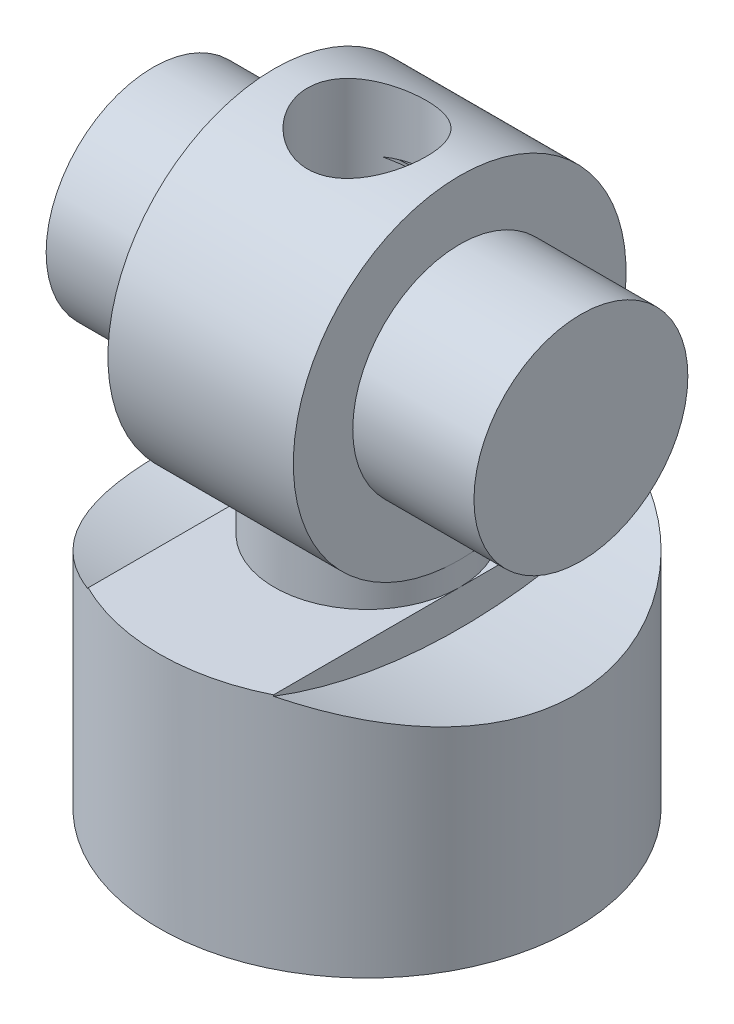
ISO-10303-21;
HEADER;
FILE_DESCRIPTION(('STEP AP214'),'2;1');
FILE_NAME('part.step','',(''),(''),'','','');
FILE_SCHEMA(('AUTOMOTIVE_DESIGN { 1 0 10303 214 1 1 1 1 }'));
ENDSEC;
DATA;
#1=APPLICATION_CONTEXT('core data for automotive mechanical design processes');
#2=APPLICATION_PROTOCOL_DEFINITION('international standard','automotive_design',2000,#1);
#3=PRODUCT_CONTEXT('',#1,'mechanical');
#4=PRODUCT('Part','Part','',(#3));
#5=PRODUCT_RELATED_PRODUCT_CATEGORY('part','',(#4));
#6=PRODUCT_DEFINITION_FORMATION('','',#4);
#7=PRODUCT_DEFINITION_CONTEXT('part definition',#1,'design');
#8=PRODUCT_DEFINITION('design','',#6,#7);
#9=PRODUCT_DEFINITION_SHAPE('','',#8);
#10=(LENGTH_UNIT() NAMED_UNIT(*) SI_UNIT(.MILLI.,.METRE.));
#11=(NAMED_UNIT(*) PLANE_ANGLE_UNIT() SI_UNIT($,.RADIAN.));
#12=(NAMED_UNIT(*) SI_UNIT($,.STERADIAN.) SOLID_ANGLE_UNIT());
#13=UNCERTAINTY_MEASURE_WITH_UNIT(LENGTH_MEASURE(1.E-05),#10,'distance_accuracy_value','');
#14=(GEOMETRIC_REPRESENTATION_CONTEXT(3) GLOBAL_UNCERTAINTY_ASSIGNED_CONTEXT((#13)) GLOBAL_UNIT_ASSIGNED_CONTEXT((#10,
#11,#12)) REPRESENTATION_CONTEXT('',''));
#15=CARTESIAN_POINT('',(0.,0.,0.));
#16=DIRECTION('',(0.,0.,1.));
#17=DIRECTION('',(1.,0.,0.));
#18=AXIS2_PLACEMENT_3D('',#15,#16,#17);
#19=CARTESIAN_POINT('',(3.9,0.,0.));
#20=DIRECTION('',(1.,0.,0.));
#21=DIRECTION('',(0.,0.,-1.));
#22=AXIS2_PLACEMENT_3D('',#19,#20,#21);
#23=CYLINDRICAL_SURFACE('',#22,7.);
#24=CARTESIAN_POINT('',(-3.9,-7.,0.));
#25=CARTESIAN_POINT('',(-3.90000031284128,-7.0000002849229,0.101146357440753));
#26=CARTESIAN_POINT('',(-3.89606076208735,-6.99780299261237,0.202288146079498));
#27=CARTESIAN_POINT('',(-3.8803553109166,-6.98907110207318,0.4038084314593));
#28=CARTESIAN_POINT('',(-3.86858664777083,-6.98253497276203,0.504186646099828));
#29=CARTESIAN_POINT('',(-3.83737541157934,-6.96529106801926,0.70335165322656));
#30=CARTESIAN_POINT('',(-3.81793498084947,-6.95458445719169,0.802138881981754));
#31=CARTESIAN_POINT('',(-3.77162646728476,-6.92927102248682,0.997460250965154));
#32=CARTESIAN_POINT('',(-3.74475533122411,-6.91466259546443,1.09399344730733));
#33=CARTESIAN_POINT('',(-3.65367488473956,-6.8656158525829,1.37844239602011));
#34=CARTESIAN_POINT('',(-3.57884423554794,-6.82586770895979,1.56217036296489));
#35=CARTESIAN_POINT('',(-3.40371798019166,-6.73570207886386,1.91400928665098));
#36=CARTESIAN_POINT('',(-3.30341621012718,-6.68528201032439,2.08211644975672));
#37=CARTESIAN_POINT('',(-3.07231715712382,-6.57405157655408,2.41123481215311));
#38=CARTESIAN_POINT('',(-2.93988015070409,-6.51276165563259,2.57093203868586));
#39=CARTESIAN_POINT('',(-2.65187991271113,-6.38792749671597,2.86710248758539));
#40=CARTESIAN_POINT('',(-2.4962931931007,-6.32438101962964,3.00355181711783));
#41=CARTESIAN_POINT('',(-2.14756313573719,-6.19461051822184,3.26342871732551));
#42=CARTESIAN_POINT('',(-1.9522073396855,-6.12877524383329,3.38410558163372));
#43=CARTESIAN_POINT('',(-1.54017690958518,-6.01028349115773,3.59036592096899));
#44=CARTESIAN_POINT('',(-1.32353352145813,-5.95760808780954,3.67599990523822));
#45=CARTESIAN_POINT('',(-0.922013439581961,-5.88301311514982,3.79393677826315));
#46=CARTESIAN_POINT('',(-0.740093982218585,-5.85694711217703,3.83368428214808));
#47=CARTESIAN_POINT('',(-0.370897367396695,-5.82184998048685,3.88678839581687));
#48=CARTESIAN_POINT('',(-0.183625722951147,-5.81280192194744,3.9001712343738));
#49=CARTESIAN_POINT('',(0.191083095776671,-5.81303377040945,3.89982520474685));
#50=CARTESIAN_POINT('',(0.37852022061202,-5.8223342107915,3.8860659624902));
#51=CARTESIAN_POINT('',(0.747931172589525,-5.85794372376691,3.83216617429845));
#52=CARTESIAN_POINT('',(0.92990134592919,-5.88426391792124,3.79200837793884));
#53=CARTESIAN_POINT('',(1.28390008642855,-5.95046957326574,3.68723511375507));
#54=CARTESIAN_POINT('',(1.45593022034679,-5.99035288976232,3.62262351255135));
#55=CARTESIAN_POINT('',(1.78727171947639,-6.07937613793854,3.47115130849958));
#56=CARTESIAN_POINT('',(1.94657809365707,-6.12851967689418,3.3842820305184));
#57=CARTESIAN_POINT('',(2.2737904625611,-6.23962592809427,3.17538598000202));
#58=CARTESIAN_POINT('',(2.43929114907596,-6.30240002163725,3.05001538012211));
#59=CARTESIAN_POINT('',(2.74839589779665,-6.4283539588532,2.77475098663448));
#60=CARTESIAN_POINT('',(2.89198236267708,-6.49153408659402,2.62483768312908));
#61=CARTESIAN_POINT('',(3.16801707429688,-6.61889865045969,2.28605157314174));
#62=CARTESIAN_POINT('',(3.29781181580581,-6.68252127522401,2.09475977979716));
#63=CARTESIAN_POINT('',(3.46646074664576,-6.76786771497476,1.79084562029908));
#64=CARTESIAN_POINT('',(3.51835131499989,-6.79464354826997,1.68666859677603));
#65=CARTESIAN_POINT('',(3.612893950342,-6.84407556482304,1.47329042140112));
#66=CARTESIAN_POINT('',(3.65555155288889,-6.8667342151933,1.36409232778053));
#67=CARTESIAN_POINT('',(3.72840544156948,-6.90580423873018,1.14932095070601));
#68=CARTESIAN_POINT('',(3.75926673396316,-6.92254271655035,1.04403213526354));
#69=CARTESIAN_POINT('',(3.81209300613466,-6.95137123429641,0.830670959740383));
#70=CARTESIAN_POINT('',(3.83406268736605,-6.96346373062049,0.722600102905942));
#71=CARTESIAN_POINT('',(3.868792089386,-6.9826458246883,0.504603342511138));
#72=CARTESIAN_POINT('',(3.88155641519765,-6.9897379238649,0.394678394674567));
#73=CARTESIAN_POINT('',(3.89769038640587,-6.99871019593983,0.173933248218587));
#74=CARTESIAN_POINT('',(3.90106096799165,-7.00059088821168,0.0631131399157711));
#75=CARTESIAN_POINT('',(3.89851220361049,-6.9991712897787,-0.145684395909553));
#76=CARTESIAN_POINT('',(3.8936119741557,-6.99643934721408,-0.243680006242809));
#77=CARTESIAN_POINT('',(3.87646786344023,-6.98691292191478,-0.438858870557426));
#78=CARTESIAN_POINT('',(3.86422167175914,-6.98011716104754,-0.536041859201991));
#79=CARTESIAN_POINT('',(3.8325365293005,-6.96262599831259,-0.728834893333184));
#80=CARTESIAN_POINT('',(3.81310029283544,-6.95193206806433,-0.824445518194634));
#81=CARTESIAN_POINT('',(3.7672642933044,-6.92689811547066,-1.01350789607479));
#82=CARTESIAN_POINT('',(3.7408618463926,-6.91255668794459,-1.10695880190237));
#83=CARTESIAN_POINT('',(3.65188020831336,-6.86467000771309,-1.38231185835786));
#84=CARTESIAN_POINT('',(3.5793522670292,-6.82616282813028,-1.56025439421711));
#85=CARTESIAN_POINT('',(3.41035528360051,-6.73908732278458,-1.90153537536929));
#86=CARTESIAN_POINT('',(3.31387989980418,-6.69051633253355,-2.06486993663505));
#87=CARTESIAN_POINT('',(3.0884274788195,-6.58161394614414,-2.39055758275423));
#88=CARTESIAN_POINT('',(2.95712331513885,-6.52058610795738,-2.5510686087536));
#89=CARTESIAN_POINT('',(2.67130243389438,-6.39603792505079,-2.8490076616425));
#90=CARTESIAN_POINT('',(2.51676008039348,-6.33251488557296,-2.98640983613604));
#91=CARTESIAN_POINT('',(2.17019140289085,-6.20252665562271,-3.24840604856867));
#92=CARTESIAN_POINT('',(1.97595074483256,-6.13642030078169,-3.37027211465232));
#93=CARTESIAN_POINT('',(1.5660225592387,-6.0169979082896,-3.57914696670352));
#94=CARTESIAN_POINT('',(1.35036576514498,-5.96366390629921,-3.66620482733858));
#95=CARTESIAN_POINT('',(0.949863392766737,-5.88745193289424,-3.78707116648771));
#96=CARTESIAN_POINT('',(0.767997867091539,-5.86053840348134,-3.82820584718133));
#97=CARTESIAN_POINT('',(0.398636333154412,-5.82368322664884,-3.88405483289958));
#98=CARTESIAN_POINT('',(0.211146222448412,-5.81372439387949,-3.89879589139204));
#99=CARTESIAN_POINT('',(-0.16431738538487,-5.81220321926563,-3.90106353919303));
#100=CARTESIAN_POINT('',(-0.352291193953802,-5.82066508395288,-3.88855431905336));
#101=CARTESIAN_POINT('',(-0.722985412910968,-5.85478864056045,-3.83697351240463));
#102=CARTESIAN_POINT('',(-0.905702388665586,-5.88046132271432,-3.79788495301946));
#103=CARTESIAN_POINT('',(-1.26056326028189,-5.94547234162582,-3.69526481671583));
#104=CARTESIAN_POINT('',(-1.43274964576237,-5.98475081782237,-3.63184018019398));
#105=CARTESIAN_POINT('',(-1.76456240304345,-6.07272836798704,-3.48273610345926));
#106=CARTESIAN_POINT('',(-1.92418392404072,-6.12143105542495,-3.39704812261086));
#107=CARTESIAN_POINT('',(-2.25197054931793,-6.23169761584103,-3.1908552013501));
#108=CARTESIAN_POINT('',(-2.41778139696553,-6.29409283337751,-3.06704558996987));
#109=CARTESIAN_POINT('',(-2.72777488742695,-6.41955139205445,-2.79497203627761));
#110=CARTESIAN_POINT('',(-2.87193982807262,-6.48261523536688,-2.64668828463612));
#111=CARTESIAN_POINT('',(-3.14998913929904,-6.61026335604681,-2.31081364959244));
#112=CARTESIAN_POINT('',(-3.28116085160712,-6.67429932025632,-2.12072173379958));
#113=CARTESIAN_POINT('',(-3.45204991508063,-6.76049282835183,-1.81846116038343));
#114=CARTESIAN_POINT('',(-3.50471596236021,-6.787588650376,-1.71481303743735));
#115=CARTESIAN_POINT('',(-3.60086999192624,-6.83773159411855,-1.5024293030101));
#116=CARTESIAN_POINT('',(-3.64436349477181,-6.86078114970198,-1.39369680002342));
#117=CARTESIAN_POINT('',(-3.71848344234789,-6.90045090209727,-1.18090483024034));
#118=CARTESIAN_POINT('',(-3.74986495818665,-6.91743981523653,-1.07717625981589));
#119=CARTESIAN_POINT('',(-3.80397740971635,-6.94692221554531,-0.866908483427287));
#120=CARTESIAN_POINT('',(-3.8267128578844,-6.95941804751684,-0.760370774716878));
#121=CARTESIAN_POINT('',(-3.86321922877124,-6.97955808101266,-0.545364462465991));
#122=CARTESIAN_POINT('',(-3.87699416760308,-6.98720445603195,-0.436896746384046));
#123=CARTESIAN_POINT('',(-3.89538409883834,-6.99742510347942,-0.218950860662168));
#124=CARTESIAN_POINT('',(-3.89999966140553,-6.99999969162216,-0.109472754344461));
#125=CARTESIAN_POINT('',(-3.9,-7.,0.));
#126=B_SPLINE_CURVE_WITH_KNOTS('',3,(#24,#25,#26,#27,#28,#29,#30,#31,#32,#33,#34,#35,#36,#37,
#38,#39,#40,#41,#42,#43,#44,#45,#46,#47,#48,#49,#50,#51,#52,#53,#54,#55,#56,#57,#58,#59,#60,#61,
#62,#63,#64,#65,#66,#67,#68,#69,#70,#71,#72,#73,#74,#75,#76,#77,#78,#79,#80,#81,#82,#83,#84,#85,
#86,#87,#88,#89,#90,#91,#92,#93,#94,#95,#96,#97,#98,#99,#100,#101,#102,#103,#104,#105,#106,#107,
#108,#109,#110,#111,#112,#113,#114,#115,#116,#117,#118,#119,#120,#121,#122,#123,#124,#125),
.UNSPECIFIED.,.T.,.F.,(4,2,2,2,2,2,2,2,2,2,2,2,2,2,2,2,2,2,2,2,2,2,2,2,2,2,2,2,2,2,2,2,2,2,2,2,
2,2,2,2,2,2,2,2,2,2,2,2,2,2,4),(0.,0.303330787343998,0.606768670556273,0.910121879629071,
1.21359992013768,1.81765602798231,2.42185845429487,3.06822728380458,3.71525645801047,
4.42832801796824,5.14036813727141,5.70199096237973,6.26305477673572,6.82474682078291,
7.38680627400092,7.94877689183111,8.51096687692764,9.15905767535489,9.80766618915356,
10.5228095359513,10.8806537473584,11.2382828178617,11.5707819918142,11.903105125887,
12.2352618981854,12.5673855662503,12.8614963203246,13.1556996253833,13.4497919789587,
13.7439978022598,14.3292696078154,14.9146965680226,15.5605601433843,16.2071415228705,
16.9195476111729,17.6309457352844,18.1936677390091,18.7558190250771,19.3187094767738,
19.8819597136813,20.4427626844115,21.0037811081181,21.6495812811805,22.2959067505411,
23.0107914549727,23.3684940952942,23.7259808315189,24.0546214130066,24.383090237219,
24.7114117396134,25.0397128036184),.UNSPECIFIED.);
#127=CARTESIAN_POINT('',(3.9,-7.,0.));
#128=VERTEX_POINT('',#127);
#129=CARTESIAN_POINT('',(-3.9,-7.,0.));
#130=VERTEX_POINT('',#129);
#131=EDGE_CURVE('E183',#128,#130,#126,.T.);
#132=ORIENTED_EDGE('',*,*,#131,.T.);
#133=CARTESIAN_POINT('',(-3.9,0.,0.));
#134=DIRECTION('',(1.,0.,0.));
#135=DIRECTION('',(0.,0.,-1.));
#136=AXIS2_PLACEMENT_3D('',#133,#134,#135);
#137=CIRCLE('',#136,7.);
#138=EDGE_CURVE('E303',#130,#130,#137,.T.);
#139=ORIENTED_EDGE('',*,*,#138,.T.);
#140=EDGE_CURVE('E312',#130,#128,#126,.T.);
#141=ORIENTED_EDGE('',*,*,#140,.T.);
#142=CARTESIAN_POINT('',(3.9,0.,0.));
#143=DIRECTION('',(1.,0.,0.));
#144=DIRECTION('',(0.,0.,-1.));
#145=AXIS2_PLACEMENT_3D('',#142,#143,#144);
#146=CIRCLE('',#145,7.);
#147=EDGE_CURVE('E306',#128,#128,#146,.T.);
#148=ORIENTED_EDGE('',*,*,#147,.F.);
#149=EDGE_LOOP('',(#132,#139,#141,#148));
#150=FACE_BOUND('',#149,.T.);
#151=CARTESIAN_POINT('',(-2.5,7.,0.));
#152=CARTESIAN_POINT('',(-2.49999223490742,6.99999423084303,-0.13564073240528));
#153=CARTESIAN_POINT('',(-2.48890866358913,6.99601508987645,-0.271414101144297));
#154=CARTESIAN_POINT('',(-2.44496507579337,6.98050486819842,-0.539073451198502));
#155=CARTESIAN_POINT('',(-2.41207047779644,6.96896179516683,-0.67095291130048));
#156=CARTESIAN_POINT('',(-2.32580712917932,6.93957817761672,-0.926706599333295));
#157=CARTESIAN_POINT('',(-2.27248899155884,6.92175320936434,-1.05059973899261));
#158=CARTESIAN_POINT('',(-2.14708821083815,6.88160372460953,-1.28763407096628));
#159=CARTESIAN_POINT('',(-2.07500711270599,6.85927957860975,-1.40077614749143));
#160=CARTESIAN_POINT('',(-1.91115888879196,6.81147433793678,-1.61758480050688));
#161=CARTESIAN_POINT('',(-1.81878583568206,6.78590953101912,-1.72077491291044));
#162=CARTESIAN_POINT('',(-1.6182590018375,6.73493649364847,-1.91057783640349));
#163=CARTESIAN_POINT('',(-1.51010025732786,6.70952831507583,-1.99718541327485));
#164=CARTESIAN_POINT('',(-1.276602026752,6.66080066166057,-2.15423743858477));
#165=CARTESIAN_POINT('',(-1.15080488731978,6.63758100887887,-2.22403549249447));
#166=CARTESIAN_POINT('',(-0.888295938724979,6.59714347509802,-2.34127586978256));
#167=CARTESIAN_POINT('',(-0.751588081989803,6.57992343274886,-2.3887262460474));
#168=CARTESIAN_POINT('',(-0.476577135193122,6.55432037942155,-2.45809130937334));
#169=CARTESIAN_POINT('',(-0.338530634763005,6.54562733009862,-2.4809052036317));
#170=CARTESIAN_POINT('',(-0.0603163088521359,6.53715061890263,-2.50316152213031));
#171=CARTESIAN_POINT('',(0.0798507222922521,6.53736369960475,-2.50261249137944));
#172=CARTESIAN_POINT('',(0.350355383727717,6.54640587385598,-2.47885081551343));
#173=CARTESIAN_POINT('',(0.480817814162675,6.55477360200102,-2.45685171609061));
#174=CARTESIAN_POINT('',(0.736061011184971,6.57842075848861,-2.39280867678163));
#175=CARTESIAN_POINT('',(0.860840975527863,6.59370115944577,-2.35076191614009));
#176=CARTESIAN_POINT('',(1.10377675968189,6.62975215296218,-2.24709441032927));
#177=CARTESIAN_POINT('',(1.22177540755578,6.65061550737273,-2.18513901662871));
#178=CARTESIAN_POINT('',(1.44606164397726,6.69544587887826,-2.04364869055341));
#179=CARTESIAN_POINT('',(1.55234602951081,6.71941374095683,-1.96410896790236));
#180=CARTESIAN_POINT('',(1.75694257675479,6.7695208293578,-1.7840468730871));
#181=CARTESIAN_POINT('',(1.85438627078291,6.79570379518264,-1.68254775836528));
#182=CARTESIAN_POINT('',(2.03114616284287,6.84604690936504,-1.46429791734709));
#183=CARTESIAN_POINT('',(2.11045421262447,6.87020614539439,-1.34754037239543));
#184=CARTESIAN_POINT('',(2.24953773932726,6.91418824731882,-1.10000408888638));
#185=CARTESIAN_POINT('',(2.30903444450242,6.93394802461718,-0.969057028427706));
#186=CARTESIAN_POINT('',(2.40477778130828,6.96641261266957,-0.698268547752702));
#187=CARTESIAN_POINT('',(2.44107169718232,6.97913176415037,-0.558445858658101));
#188=CARTESIAN_POINT('',(2.47668095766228,6.99169887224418,-0.347747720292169));
#189=CARTESIAN_POINT('',(2.48541369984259,6.99480177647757,-0.278535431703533));
#190=CARTESIAN_POINT('',(2.49707521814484,6.99895382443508,-0.139560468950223));
#191=CARTESIAN_POINT('',(2.50000399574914,7.00000296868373,-0.0697977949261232));
#192=CARTESIAN_POINT('',(2.49999223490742,6.99999423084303,0.135640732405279));
#193=CARTESIAN_POINT('',(2.48890866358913,6.99601508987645,0.271414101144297));
#194=CARTESIAN_POINT('',(2.44496507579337,6.98050486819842,0.539073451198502));
#195=CARTESIAN_POINT('',(2.41207047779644,6.96896179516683,0.67095291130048));
#196=CARTESIAN_POINT('',(2.32580712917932,6.93957817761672,0.926706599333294));
#197=CARTESIAN_POINT('',(2.27248899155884,6.92175320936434,1.05059973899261));
#198=CARTESIAN_POINT('',(2.14708821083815,6.88160372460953,1.28763407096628));
#199=CARTESIAN_POINT('',(2.07500711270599,6.85927957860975,1.40077614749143));
#200=CARTESIAN_POINT('',(1.91115888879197,6.81147433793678,1.61758480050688));
#201=CARTESIAN_POINT('',(1.81878583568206,6.78590953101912,1.72077491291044));
#202=CARTESIAN_POINT('',(1.6182590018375,6.73493649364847,1.91057783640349));
#203=CARTESIAN_POINT('',(1.51010025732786,6.70952831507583,1.99718541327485));
#204=CARTESIAN_POINT('',(1.276602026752,6.66080066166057,2.15423743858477));
#205=CARTESIAN_POINT('',(1.15080488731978,6.63758100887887,2.22403549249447));
#206=CARTESIAN_POINT('',(0.88829593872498,6.59714347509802,2.34127586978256));
#207=CARTESIAN_POINT('',(0.751588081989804,6.57992343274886,2.3887262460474));
#208=CARTESIAN_POINT('',(0.476577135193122,6.55432037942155,2.45809130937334));
#209=CARTESIAN_POINT('',(0.338530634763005,6.54562733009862,2.4809052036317));
#210=CARTESIAN_POINT('',(0.060316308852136,6.53715061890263,2.50316152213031));
#211=CARTESIAN_POINT('',(-0.0798507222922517,6.53736369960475,2.50261249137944));
#212=CARTESIAN_POINT('',(-0.350355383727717,6.54640587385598,2.47885081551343));
#213=CARTESIAN_POINT('',(-0.480817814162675,6.55477360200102,2.45685171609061));
#214=CARTESIAN_POINT('',(-0.736061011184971,6.57842075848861,2.39280867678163));
#215=CARTESIAN_POINT('',(-0.860840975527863,6.59370115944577,2.35076191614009));
#216=CARTESIAN_POINT('',(-1.10377675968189,6.62975215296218,2.24709441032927));
#217=CARTESIAN_POINT('',(-1.22177540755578,6.65061550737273,2.18513901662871));
#218=CARTESIAN_POINT('',(-1.44606164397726,6.69544587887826,2.04364869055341));
#219=CARTESIAN_POINT('',(-1.55234602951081,6.71941374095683,1.96410896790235));
#220=CARTESIAN_POINT('',(-1.75694257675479,6.7695208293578,1.7840468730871));
#221=CARTESIAN_POINT('',(-1.85438627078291,6.79570379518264,1.68254775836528));
#222=CARTESIAN_POINT('',(-2.03114616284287,6.84604690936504,1.46429791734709));
#223=CARTESIAN_POINT('',(-2.11045421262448,6.87020614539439,1.34754037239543));
#224=CARTESIAN_POINT('',(-2.24953773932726,6.91418824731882,1.10000408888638));
#225=CARTESIAN_POINT('',(-2.30903444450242,6.93394802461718,0.969057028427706));
#226=CARTESIAN_POINT('',(-2.40477778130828,6.96641261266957,0.698268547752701));
#227=CARTESIAN_POINT('',(-2.44107169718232,6.97913176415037,0.5584458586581));
#228=CARTESIAN_POINT('',(-2.47668095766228,6.99169887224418,0.347747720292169));
#229=CARTESIAN_POINT('',(-2.48541369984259,6.99480177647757,0.278535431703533));
#230=CARTESIAN_POINT('',(-2.49707521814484,6.99895382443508,0.139560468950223));
#231=CARTESIAN_POINT('',(-2.50000399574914,7.00000296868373,0.0697977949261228));
#232=CARTESIAN_POINT('',(-2.5,7.,0.));
#233=B_SPLINE_CURVE_WITH_KNOTS('',3,(#151,#152,#153,#154,#155,#156,#157,#158,#159,#160,#161,
#162,#163,#164,#165,#166,#167,#168,#169,#170,#171,#172,#173,#174,#175,#176,#177,#178,#179,#180,
#181,#182,#183,#184,#185,#186,#187,#188,#189,#190,#191,#192,#193,#194,#195,#196,#197,#198,#199,
#200,#201,#202,#203,#204,#205,#206,#207,#208,#209,#210,#211,#212,#213,#214,#215,#216,#217,#218,
#219,#220,#221,#222,#223,#224,#225,#226,#227,#228,#229,#230,#231,#232),.UNSPECIFIED.,.T.,.F.,(4,
2,2,2,2,2,2,2,2,2,2,2,2,2,2,2,2,2,2,2,2,2,2,2,2,2,2,2,2,2,2,2,2,2,2,2,2,2,2,2,4),(0.,
0.406652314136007,0.8139509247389,1.22024664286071,1.62650891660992,2.0471353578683,
2.46789435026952,2.90289671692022,3.3377422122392,3.75611572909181,4.17433622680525,
4.57019166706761,4.96610282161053,5.36905142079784,5.77210992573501,6.1994977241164,
6.62707716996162,7.06044132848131,7.4929195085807,7.70217407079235,7.91142857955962,
8.31808089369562,8.72537950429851,9.13167522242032,9.53793749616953,9.95856393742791,
10.3793229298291,10.8143252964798,11.2491707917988,11.6675443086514,12.0857648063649,
12.4816202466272,12.8775314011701,13.2804800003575,13.6835385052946,14.110926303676,
14.5385057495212,14.9718699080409,15.4043480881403,15.613602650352,15.8228571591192),.UNSPECIFIED.);
#234=CARTESIAN_POINT('',(-2.5,7.,0.));
#235=VERTEX_POINT('',#234);
#236=EDGE_CURVE('E108',#235,#235,#233,.T.);
#237=ORIENTED_EDGE('',*,*,#236,.T.);
#238=EDGE_LOOP('',(#237));
#239=FACE_BOUND('',#238,.T.);
#240=ADVANCED_FACE('F14',(#150,#239),#23,.T.);
#241=CARTESIAN_POINT('',(9.,0.,0.));
#242=DIRECTION('',(-1.,0.,0.));
#243=DIRECTION('',(0.,0.,1.));
#244=AXIS2_PLACEMENT_3D('',#241,#242,#243);
#245=CYLINDRICAL_SURFACE('',#244,4.5);
#246=CARTESIAN_POINT('',(0.,-3.74165738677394,2.5));
#247=CARTESIAN_POINT('',(0.127867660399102,-3.7416726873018,2.4999886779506));
#248=CARTESIAN_POINT('',(0.255847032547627,-3.74831704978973,2.49012046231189));
#249=CARTESIAN_POINT('',(0.507679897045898,-3.77384839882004,2.45123834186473));
#250=CARTESIAN_POINT('',(0.631526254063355,-3.79275551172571,2.42219296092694));
#251=CARTESIAN_POINT('',(0.870945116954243,-3.83989933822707,2.34672518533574));
#252=CARTESIAN_POINT('',(0.986564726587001,-3.86807667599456,2.30041313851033));
#253=CARTESIAN_POINT('',(1.20834600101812,-3.93048941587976,2.19206578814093));
#254=CARTESIAN_POINT('',(1.31450555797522,-3.96472616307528,2.13002699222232));
#255=CARTESIAN_POINT('',(1.52641671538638,-4.03969403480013,1.98449846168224));
#256=CARTESIAN_POINT('',(1.63099357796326,-4.08073069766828,1.89945493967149));
#257=CARTESIAN_POINT('',(1.82534633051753,-4.16222299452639,1.71353751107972));
#258=CARTESIAN_POINT('',(1.91511315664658,-4.20267825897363,1.61265398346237));
#259=CARTESIAN_POINT('',(2.08508983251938,-4.28269640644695,1.3870985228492));
#260=CARTESIAN_POINT('',(2.1637603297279,-4.32186646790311,1.26111369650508));
#261=CARTESIAN_POINT('',(2.29824166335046,-4.39073714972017,0.995108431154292));
#262=CARTESIAN_POINT('',(2.35407027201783,-4.4204451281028,0.85509901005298));
#263=CARTESIAN_POINT('',(2.43630568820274,-4.46480622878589,0.577542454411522));
#264=CARTESIAN_POINT('',(2.46480060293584,-4.48051966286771,0.440787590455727));
#265=CARTESIAN_POINT('',(2.49853448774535,-4.49916269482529,0.163616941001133));
#266=CARTESIAN_POINT('',(2.50379152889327,-4.50210222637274,0.0232040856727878));
#267=CARTESIAN_POINT('',(2.4914765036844,-4.4952695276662,-0.241178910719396));
#268=CARTESIAN_POINT('',(2.47628215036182,-4.48682112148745,-0.365303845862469));
#269=CARTESIAN_POINT('',(2.42789099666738,-4.46029652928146,-0.608906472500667));
#270=CARTESIAN_POINT('',(2.39469280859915,-4.44221960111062,-0.72838380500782));
#271=CARTESIAN_POINT('',(2.31126649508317,-4.39780601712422,-0.960979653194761));
#272=CARTESIAN_POINT('',(2.26086630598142,-4.37138611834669,-1.07401990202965));
#273=CARTESIAN_POINT('',(2.14483738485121,-4.31251997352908,-1.29025059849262));
#274=CARTESIAN_POINT('',(2.07920386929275,-4.28007183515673,-1.39343793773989));
#275=CARTESIAN_POINT('',(1.92640653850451,-4.20785286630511,-1.59909620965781));
#276=CARTESIAN_POINT('',(1.83767397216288,-4.16766932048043,-1.70025747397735));
#277=CARTESIAN_POINT('',(1.64533173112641,-4.08650106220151,-1.88703556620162));
#278=CARTESIAN_POINT('',(1.54170632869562,-4.04551554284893,-1.97263574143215));
#279=CARTESIAN_POINT('',(1.31107929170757,-3.96312397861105,-2.13367090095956));
#280=CARTESIAN_POINT('',(1.1828097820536,-3.92201714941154,-2.2074790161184));
#281=CARTESIAN_POINT('',(0.980669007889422,-3.86749177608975,-2.30082855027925));
#282=CARTESIAN_POINT('',(0.911652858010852,-3.8505034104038,-2.32905476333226));
#283=CARTESIAN_POINT('',(0.770776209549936,-3.81960529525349,-2.3793879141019));
#284=CARTESIAN_POINT('',(0.698917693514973,-3.80569344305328,-2.4014990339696));
#285=CARTESIAN_POINT('',(0.558744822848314,-3.7825660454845,-2.43774893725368));
#286=CARTESIAN_POINT('',(0.49060568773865,-3.77306418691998,-2.45238335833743));
#287=CARTESIAN_POINT('',(0.352979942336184,-3.75764870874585,-2.47593920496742));
#288=CARTESIAN_POINT('',(0.283494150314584,-3.75173297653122,-2.48486399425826));
#289=CARTESIAN_POINT('',(0.143844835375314,-3.7437735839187,-2.49684067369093));
#290=CARTESIAN_POINT('',(0.0736818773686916,-3.74172693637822,-2.49989709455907));
#291=CARTESIAN_POINT('',(-0.0666321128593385,-3.74159115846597,-2.5000979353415));
#292=CARTESIAN_POINT('',(-0.136783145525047,-3.74350157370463,-2.49724303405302));
#293=CARTESIAN_POINT('',(-0.32521266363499,-3.75390669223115,-2.48160454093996));
#294=CARTESIAN_POINT('',(-0.442885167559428,-3.7660681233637,-2.46327912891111));
#295=CARTESIAN_POINT('',(-0.673061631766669,-3.79999671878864,-2.41059641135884));
#296=CARTESIAN_POINT('',(-0.785563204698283,-3.8217682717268,-2.37623178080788));
#297=CARTESIAN_POINT('',(-1.00774180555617,-3.8734200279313,-2.29111009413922));
#298=CARTESIAN_POINT('',(-1.11711092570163,-3.90359765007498,-2.23973536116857));
#299=CARTESIAN_POINT('',(-1.32632576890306,-3.96852930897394,-2.12255957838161));
#300=CARTESIAN_POINT('',(-1.42616680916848,-4.00328557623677,-2.05675148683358));
#301=CARTESIAN_POINT('',(-1.63049062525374,-4.08021308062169,-1.90016864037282));
#302=CARTESIAN_POINT('',(-1.73309682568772,-4.12267224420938,-1.80707526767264));
#303=CARTESIAN_POINT('',(-1.92199935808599,-4.20557655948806,-1.60470900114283));
#304=CARTESIAN_POINT('',(-2.00828561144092,-4.24602045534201,-1.49542618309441));
#305=CARTESIAN_POINT('',(-2.16643294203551,-4.32300875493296,-1.25626042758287));
#306=CARTESIAN_POINT('',(-2.23726807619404,-4.3592262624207,-1.12558547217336));
#307=CARTESIAN_POINT('',(-2.35519631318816,-4.42090637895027,-0.851602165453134));
#308=CARTESIAN_POINT('',(-2.40231447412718,-4.44638033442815,-0.708307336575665));
#309=CARTESIAN_POINT('',(-2.46664777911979,-4.48148519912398,-0.428990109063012));
#310=CARTESIAN_POINT('',(-2.48643742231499,-4.49247473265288,-0.29373267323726));
#311=CARTESIAN_POINT('',(-2.50362240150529,-4.5020067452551,-0.0213910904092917));
#312=CARTESIAN_POINT('',(-2.50103007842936,-4.50055608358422,0.115692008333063));
#313=CARTESIAN_POINT('',(-2.47491437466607,-4.4861017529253,0.374337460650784));
#314=CARTESIAN_POINT('',(-2.45334235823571,-4.47417531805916,0.49616574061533));
#315=CARTESIAN_POINT('',(-2.39292228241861,-4.44133257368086,0.734167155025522));
#316=CARTESIAN_POINT('',(-2.3540722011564,-4.42041521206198,0.8503396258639));
#317=CARTESIAN_POINT('',(-2.25905612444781,-4.3705432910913,1.07814775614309));
#318=CARTESIAN_POINT('',(-2.202363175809,-4.34134725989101,1.18950897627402));
#319=CARTESIAN_POINT('',(-2.07393542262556,-4.27762772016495,1.40148896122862));
#320=CARTESIAN_POINT('',(-2.00219469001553,-4.24310211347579,1.50210346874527));
#321=CARTESIAN_POINT('',(-1.83613517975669,-4.16717195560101,1.70217916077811));
#322=CARTESIAN_POINT('',(-1.74016022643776,-4.12543450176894,1.8001424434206));
#323=CARTESIAN_POINT('',(-1.53330418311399,-4.04252541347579,1.97933250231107));
#324=CARTESIAN_POINT('',(-1.42240466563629,-4.0013545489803,2.06053826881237));
#325=CARTESIAN_POINT('',(-1.17899936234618,-3.92122408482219,2.20944802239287));
#326=CARTESIAN_POINT('',(-1.04552040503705,-3.88262653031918,2.27579178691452));
#327=CARTESIAN_POINT('',(-0.836526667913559,-3.83343009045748,2.35707752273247));
#328=CARTESIAN_POINT('',(-0.765460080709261,-3.81848976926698,2.38112244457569));
#329=CARTESIAN_POINT('',(-0.620861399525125,-3.79215325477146,2.4228459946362));
#330=CARTESIAN_POINT('',(-0.547330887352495,-3.78075483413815,2.44052862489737));
#331=CARTESIAN_POINT('',(-0.395409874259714,-3.7617084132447,2.4697920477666));
#332=CARTESIAN_POINT('',(-0.316943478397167,-3.75423236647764,2.48109451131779));
#333=CARTESIAN_POINT('',(-0.158999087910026,-3.74420222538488,2.49620181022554));
#334=CARTESIAN_POINT('',(-0.0795211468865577,-3.74164787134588,2.50000704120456));
#335=CARTESIAN_POINT('',(0.,-3.74165738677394,2.5));
#336=B_SPLINE_CURVE_WITH_KNOTS('',3,(#246,#247,#248,#249,#250,#251,#252,#253,#254,#255,#256,
#257,#258,#259,#260,#261,#262,#263,#264,#265,#266,#267,#268,#269,#270,#271,#272,#273,#274,#275,
#276,#277,#278,#279,#280,#281,#282,#283,#284,#285,#286,#287,#288,#289,#290,#291,#292,#293,#294,
#295,#296,#297,#298,#299,#300,#301,#302,#303,#304,#305,#306,#307,#308,#309,#310,#311,#312,#313,
#314,#315,#316,#317,#318,#319,#320,#321,#322,#323,#324,#325,#326,#327,#328,#329,#330,#331,#332,
#333,#334,#335),.UNSPECIFIED.,.T.,.F.,(4,2,2,2,2,2,2,2,2,2,2,2,2,2,2,2,2,2,2,2,2,2,2,2,2,2,2,2,
2,2,2,2,2,2,2,2,2,2,2,2,2,2,2,2,4),(0.,0.383275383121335,0.767181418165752,1.14867490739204,
1.53025318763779,1.95124472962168,2.37249297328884,2.8308639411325,3.2888775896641,
3.70817544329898,4.12714717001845,4.50138183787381,4.8756453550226,5.25376784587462,
5.63200923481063,6.05157027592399,6.47157769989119,6.92969119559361,7.15882945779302,
7.38781062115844,7.59850621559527,7.80907756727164,8.01948627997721,8.22987083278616,
8.58719279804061,8.94467811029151,9.31690871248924,9.68932132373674,10.122176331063,
10.5552977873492,11.0117233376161,11.4676656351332,11.8767730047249,12.2856548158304,
12.6568475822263,13.0280837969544,13.4115163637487,13.7951002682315,14.2233400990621,
14.6521136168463,15.1111969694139,15.3403711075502,15.5694008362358,15.80777312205,
16.0461328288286),.UNSPECIFIED.);
#337=CARTESIAN_POINT('',(0.,-3.74165738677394,2.5));
#338=VERTEX_POINT('',#337);
#339=EDGE_CURVE('E100',#338,#338,#336,.T.);
#340=ORIENTED_EDGE('',*,*,#339,.T.);
#341=EDGE_LOOP('',(#340));
#342=FACE_BOUND('',#341,.T.);
#343=CARTESIAN_POINT('',(0.,-3.30870065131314,-3.05));
#344=CARTESIAN_POINT('',(0.0740543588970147,-3.30870135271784,-3.04999955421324));
#345=CARTESIAN_POINT('',(0.148113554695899,-3.31120079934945,-3.04729547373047));
#346=CARTESIAN_POINT('',(0.29550128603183,-3.32105327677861,-3.03655247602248));
#347=CARTESIAN_POINT('',(0.368829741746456,-3.32840683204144,-3.02851298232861));
#348=CARTESIAN_POINT('',(0.586950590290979,-3.35728100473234,-2.99658701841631));
#349=CARTESIAN_POINT('',(0.729787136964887,-3.385614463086,-2.96489335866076));
#350=CARTESIAN_POINT('',(1.00481607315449,-3.45535402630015,-2.88328172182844));
#351=CARTESIAN_POINT('',(1.13710040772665,-3.49662694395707,-2.83354864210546));
#352=CARTESIAN_POINT('',(1.39123632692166,-3.58733287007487,-2.71780374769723));
#353=CARTESIAN_POINT('',(1.51308617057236,-3.6367672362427,-2.65178922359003));
#354=CARTESIAN_POINT('',(1.76446479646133,-3.74781440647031,-2.49293203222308));
#355=CARTESIAN_POINT('',(1.89204410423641,-3.81010328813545,-2.39747643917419));
#356=CARTESIAN_POINT('',(2.13108358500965,-3.93428541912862,-2.18776550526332));
#357=CARTESIAN_POINT('',(2.24252540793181,-3.99617814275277,-2.07348907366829));
#358=CARTESIAN_POINT('',(2.46301512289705,-4.1236708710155,-1.80832137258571));
#359=CARTESIAN_POINT('',(2.56913328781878,-4.18840811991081,-1.65450535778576));
#360=CARTESIAN_POINT('',(2.70696690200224,-4.27480018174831,-1.40843177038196));
#361=CARTESIAN_POINT('',(2.74934801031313,-4.30180769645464,-1.3238668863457));
#362=CARTESIAN_POINT('',(2.82644155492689,-4.35148238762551,-1.15011183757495));
#363=CARTESIAN_POINT('',(2.86115705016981,-4.37415129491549,-1.06092353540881));
#364=CARTESIAN_POINT('',(2.93723315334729,-4.42421178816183,-0.834029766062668));
#365=CARTESIAN_POINT('',(2.97356864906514,-4.44850916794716,-0.693888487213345));
#366=CARTESIAN_POINT('',(3.02602447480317,-4.48374237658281,-0.408328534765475));
#367=CARTESIAN_POINT('',(3.04216027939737,-4.49468843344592,-0.262913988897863));
#368=CARTESIAN_POINT('',(3.05336718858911,-4.5022807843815,0.0293654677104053));
#369=CARTESIAN_POINT('',(3.04840293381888,-4.49890307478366,0.176232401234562));
#370=CARTESIAN_POINT('',(3.01761506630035,-4.47809945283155,0.466749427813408));
#371=CARTESIAN_POINT('',(2.99178532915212,-4.46066941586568,0.610398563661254));
#372=CARTESIAN_POINT('',(2.92131598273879,-4.41371882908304,0.888013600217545));
#373=CARTESIAN_POINT('',(2.87702540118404,-4.38442289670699,1.02210773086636));
#374=CARTESIAN_POINT('',(2.77159197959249,-4.31597239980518,1.28074304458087));
#375=CARTESIAN_POINT('',(2.71044594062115,-4.27681596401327,1.40528240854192));
#376=CARTESIAN_POINT('',(2.56551457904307,-4.18638203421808,1.65649516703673));
#377=CARTESIAN_POINT('',(2.47995424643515,-4.13423576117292,1.78182668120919));
#378=CARTESIAN_POINT('',(2.29260341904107,-4.02464324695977,2.01721180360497));
#379=CARTESIAN_POINT('',(2.19079412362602,-3.96719089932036,2.12724743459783));
#380=CARTESIAN_POINT('',(1.95420691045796,-3.841187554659,2.34819750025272));
#381=CARTESIAN_POINT('',(1.81676442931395,-3.7723979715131,2.4561343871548));
#382=CARTESIAN_POINT('',(1.52359640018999,-3.64029455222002,2.64798057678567));
#383=CARTESIAN_POINT('',(1.36788117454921,-3.57697765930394,2.7319033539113));
#384=CARTESIAN_POINT('',(1.07873972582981,-3.4781328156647,2.85610629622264));
#385=CARTESIAN_POINT('',(0.948783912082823,-3.43957561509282,2.90201639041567));
#386=CARTESIAN_POINT('',(0.680934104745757,-3.37555318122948,2.97625031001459));
#387=CARTESIAN_POINT('',(0.54305511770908,-3.35006405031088,3.00460625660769));
#388=CARTESIAN_POINT('',(0.261369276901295,-3.31605166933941,3.04212029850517));
#389=CARTESIAN_POINT('',(0.117523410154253,-3.30766771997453,3.05112079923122));
#390=CARTESIAN_POINT('',(-0.169846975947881,-3.30994043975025,3.04865479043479));
#391=CARTESIAN_POINT('',(-0.313371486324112,-3.32059763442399,3.03718771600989));
#392=CARTESIAN_POINT('',(-0.579273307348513,-3.35672225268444,2.99716587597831));
#393=CARTESIAN_POINT('',(-0.702224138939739,-3.3804057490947,2.97065905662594));
#394=CARTESIAN_POINT('',(-0.941707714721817,-3.43813602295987,2.9036484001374));
#395=CARTESIAN_POINT('',(-1.05823445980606,-3.47219229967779,2.86313172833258));
#396=CARTESIAN_POINT('',(-1.33453129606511,-3.56435394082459,2.74826045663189));
#397=CARTESIAN_POINT('',(-1.49008084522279,-3.62637602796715,2.6668870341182));
#398=CARTESIAN_POINT('',(-1.78349065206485,-3.75646016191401,2.48031899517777));
#399=CARTESIAN_POINT('',(-1.9213174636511,-3.82453323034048,2.37508034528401));
#400=CARTESIAN_POINT('',(-2.17938375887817,-3.9604362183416,2.14091948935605));
#401=CARTESIAN_POINT('',(-2.29935531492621,-4.02824992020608,2.01169148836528));
#402=CARTESIAN_POINT('',(-2.51660188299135,-4.1560914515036,1.7321777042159));
#403=CARTESIAN_POINT('',(-2.61391283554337,-4.21613154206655,1.58192588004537));
#404=CARTESIAN_POINT('',(-2.7672445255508,-4.31303677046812,1.2910804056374));
#405=CARTESIAN_POINT('',(-2.82752395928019,-4.35212259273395,1.15347804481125));
#406=CARTESIAN_POINT('',(-2.92771339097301,-4.41786925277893,0.868215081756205));
#407=CARTESIAN_POINT('',(-2.96763645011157,-4.44453805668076,0.720560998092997));
#408=CARTESIAN_POINT('',(-3.02511265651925,-4.48311795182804,0.418279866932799));
#409=CARTESIAN_POINT('',(-3.04255880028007,-4.49495844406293,0.263623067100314));
#410=CARTESIAN_POINT('',(-3.05359112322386,-4.50243250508,-0.0469294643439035));
#411=CARTESIAN_POINT('',(-3.04718207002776,-4.49806931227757,-0.202824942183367));
#412=CARTESIAN_POINT('',(-3.01241336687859,-4.47459437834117,-0.498210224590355));
#413=CARTESIAN_POINT('',(-2.98584821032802,-4.45668871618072,-0.638015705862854));
#414=CARTESIAN_POINT('',(-2.91428327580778,-4.40906289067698,-0.910676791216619));
#415=CARTESIAN_POINT('',(-2.86928056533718,-4.37934084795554,-1.04353128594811));
#416=CARTESIAN_POINT('',(-2.75996758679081,-4.30849145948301,-1.30628099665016));
#417=CARTESIAN_POINT('',(-2.6947819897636,-4.26685537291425,-1.43567105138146));
#418=CARTESIAN_POINT('',(-2.54831500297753,-4.17589690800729,-1.68200981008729));
#419=CARTESIAN_POINT('',(-2.46702497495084,-4.12657040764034,-1.79895178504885));
#420=CARTESIAN_POINT('',(-2.27621742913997,-4.01518689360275,-2.03669083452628));
#421=CARTESIAN_POINT('',(-2.16426874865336,-3.95235046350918,-2.15517053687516));
#422=CARTESIAN_POINT('',(-1.92324507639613,-3.82568072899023,-2.37276837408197));
#423=CARTESIAN_POINT('',(-1.79415533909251,-3.76184660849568,-2.47186965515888));
#424=CARTESIAN_POINT('',(-1.52700320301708,-3.6422101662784,-2.64476720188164));
#425=CARTESIAN_POINT('',(-1.38971103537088,-3.58616592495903,-2.71958017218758));
#426=CARTESIAN_POINT('',(-1.10202420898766,-3.48481309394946,-2.84829695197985));
#427=CARTESIAN_POINT('',(-0.951651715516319,-3.43948680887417,-2.90223532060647));
#428=CARTESIAN_POINT('',(-0.668272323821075,-3.37324804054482,-2.97881254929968));
#429=CARTESIAN_POINT('',(-0.537042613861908,-3.34940288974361,-3.00534763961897));
#430=CARTESIAN_POINT('',(-0.337187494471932,-3.32517436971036,-3.03205239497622));
#431=CARTESIAN_POINT('',(-0.270072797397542,-3.3190214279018,-3.03877098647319));
#432=CARTESIAN_POINT('',(-0.135306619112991,-3.31078493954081,-3.04774423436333));
#433=CARTESIAN_POINT('',(-0.0676553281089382,-3.30870001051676,-3.05000040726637));
#434=CARTESIAN_POINT('',(0.,-3.30870065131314,-3.05));
#435=B_SPLINE_CURVE_WITH_KNOTS('',3,(#343,#344,#345,#346,#347,#348,#349,#350,#351,#352,#353,
#354,#355,#356,#357,#358,#359,#360,#361,#362,#363,#364,#365,#366,#367,#368,#369,#370,#371,#372,
#373,#374,#375,#376,#377,#378,#379,#380,#381,#382,#383,#384,#385,#386,#387,#388,#389,#390,#391,
#392,#393,#394,#395,#396,#397,#398,#399,#400,#401,#402,#403,#404,#405,#406,#407,#408,#409,#410,
#411,#412,#413,#414,#415,#416,#417,#418,#419,#420,#421,#422,#423,#424,#425,#426,#427,#428,#429,
#430,#431,#432,#433,#434),.UNSPECIFIED.,.T.,.F.,(4,2,2,2,2,2,2,2,2,2,2,2,2,2,2,2,2,2,2,2,2,2,2,
2,2,2,2,2,2,2,2,2,2,2,2,2,2,2,2,2,2,2,2,2,2,4),(0.,0.222074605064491,0.444173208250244,
0.888639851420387,1.32867397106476,1.76878136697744,2.28012572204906,2.79204704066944,
3.3816546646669,3.67634407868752,3.97091568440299,4.40924515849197,4.84723863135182,
5.28596638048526,5.72482295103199,6.1557338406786,6.58672656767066,7.06630172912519,
7.54643585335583,8.10749203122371,8.66823277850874,9.09600687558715,9.52299588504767,
9.95344853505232,10.3839130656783,10.7663784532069,11.1491951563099,11.7047959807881,
12.2614304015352,12.8257196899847,13.3891078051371,13.8528597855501,14.3163138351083,
14.7819661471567,15.247525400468,15.6758920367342,16.104326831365,16.5548361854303,
17.0055878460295,17.527655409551,18.0501750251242,18.5465955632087,19.0421906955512,
19.4481632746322,19.6511174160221,19.8540025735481),.UNSPECIFIED.);
#436=CARTESIAN_POINT('',(0.,-3.30870065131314,-3.05));
#437=VERTEX_POINT('',#436);
#438=EDGE_CURVE('E245',#437,#437,#435,.T.);
#439=ORIENTED_EDGE('',*,*,#438,.T.);
#440=EDGE_LOOP('',(#439));
#441=FACE_BOUND('',#440,.T.);
#442=ADVANCED_FACE('F167',(#342,#441),#245,.T.);
#443=CARTESIAN_POINT('',(0.,-18.,0.));
#444=DIRECTION('',(0.,-1.,0.));
#445=DIRECTION('',(0.,0.,-1.));
#446=AXIS2_PLACEMENT_3D('',#443,#444,#445);
#447=CYLINDRICAL_SURFACE('',#446,8.75);
#448=CARTESIAN_POINT('',(0.,-18.,0.));
#449=DIRECTION('',(0.,-1.,0.));
#450=DIRECTION('',(0.,0.,-1.));
#451=AXIS2_PLACEMENT_3D('',#448,#449,#450);
#452=CIRCLE('',#451,8.75);
#453=CARTESIAN_POINT('',(0.,-18.,-8.75));
#454=VERTEX_POINT('',#453);
#455=EDGE_CURVE('E294',#454,#454,#452,.T.);
#456=ORIENTED_EDGE('',*,*,#455,.F.);
#457=EDGE_LOOP('',(#456));
#458=FACE_BOUND('',#457,.T.);
#459=DIRECTION('',(0.,-1.,0.));
#460=VECTOR('',#459,1.);
#461=CARTESIAN_POINT('',(3.9,-18.,7.83278366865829));
#462=LINE('',#461,#460);
#463=CARTESIAN_POINT('',(3.9,-8.,7.83278366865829));
#464=VERTEX_POINT('',#463);
#465=CARTESIAN_POINT('',(3.9,-8.05467298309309,7.83278366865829));
#466=VERTEX_POINT('',#465);
#467=EDGE_CURVE('E291',#464,#466,#462,.T.);
#468=ORIENTED_EDGE('',*,*,#467,.F.);
#469=CARTESIAN_POINT('',(0.,-8.,0.));
#470=DIRECTION('',(0.,-1.,0.));
#471=DIRECTION('',(0.,0.,-1.));
#472=AXIS2_PLACEMENT_3D('',#469,#470,#471);
#473=CIRCLE('',#472,8.75);
#474=CARTESIAN_POINT('',(-3.9,-8.,7.83278366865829));
#475=VERTEX_POINT('',#474);
#476=EDGE_CURVE('E297',#464,#475,#473,.T.);
#477=ORIENTED_EDGE('',*,*,#476,.T.);
#478=DIRECTION('',(0.,-1.,0.));
#479=VECTOR('',#478,1.);
#480=CARTESIAN_POINT('',(-3.9,-18.,7.83278366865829));
#481=LINE('',#480,#479);
#482=CARTESIAN_POINT('',(-3.9,-8.05467298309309,7.83278366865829));
#483=VERTEX_POINT('',#482);
#484=EDGE_CURVE('E281',#483,#475,#481,.F.);
#485=ORIENTED_EDGE('',*,*,#484,.F.);
#486=CARTESIAN_POINT('',(-3.9,-8.05467298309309,-7.83278366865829));
#487=CARTESIAN_POINT('',(-4.12452384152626,-8.09737217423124,-7.721006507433));
#488=CARTESIAN_POINT('',(-4.34380093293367,-8.1426514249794,-7.5997666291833));
#489=CARTESIAN_POINT('',(-4.77055982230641,-8.23689755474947,-7.33939091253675));
#490=CARTESIAN_POINT('',(-4.97804428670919,-8.28586359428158,-7.20025914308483));
#491=CARTESIAN_POINT('',(-5.38011565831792,-8.38605555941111,-6.90500663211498));
#492=CARTESIAN_POINT('',(-5.57469632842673,-8.43728255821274,-6.74887776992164));
#493=CARTESIAN_POINT('',(-5.94972754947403,-8.54050248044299,-6.42069527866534));
#494=CARTESIAN_POINT('',(-6.13017736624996,-8.59249544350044,-6.24864082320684));
#495=CARTESIAN_POINT('',(-6.4758207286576,-8.69578877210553,-5.88967916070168));
#496=CARTESIAN_POINT('',(-6.64101593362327,-8.74708921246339,-5.7027735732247));
#497=CARTESIAN_POINT('',(-6.95509462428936,-8.8475918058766,-5.31520163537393));
#498=CARTESIAN_POINT('',(-7.10397859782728,-8.89679402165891,-5.11453569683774));
#499=CARTESIAN_POINT('',(-7.3843624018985,-8.99174565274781,-4.70065534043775));
#500=CARTESIAN_POINT('',(-7.51586399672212,-9.03749541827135,-4.4874421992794));
#501=CARTESIAN_POINT('',(-7.76039107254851,-9.12425375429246,-4.04988941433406));
#502=CARTESIAN_POINT('',(-7.87342610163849,-9.16526477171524,-3.82555559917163));
#503=CARTESIAN_POINT('',(-8.07907473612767,-9.24103260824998,-3.36942343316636));
#504=CARTESIAN_POINT('',(-8.17187940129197,-9.2758473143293,-3.13772094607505));
#505=CARTESIAN_POINT('',(-8.33757753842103,-9.33872146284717,-2.66640099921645));
#506=CARTESIAN_POINT('',(-8.41047104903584,-9.36678091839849,-2.42678355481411));
#507=CARTESIAN_POINT('',(-8.5355569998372,-9.41531310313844,-1.94152657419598));
#508=CARTESIAN_POINT('',(-8.58775595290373,-9.43578821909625,-1.69588895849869));
#509=CARTESIAN_POINT('',(-8.67089101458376,-9.46854701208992,-1.2005061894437));
#510=CARTESIAN_POINT('',(-8.70182846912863,-9.48083120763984,-0.950761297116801));
#511=CARTESIAN_POINT('',(-8.7407495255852,-9.49630702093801,-0.4658358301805));
#512=CARTESIAN_POINT('',(-8.750113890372,-9.50004546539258,-0.2307824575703));
#513=CARTESIAN_POINT('',(-8.7498840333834,-9.49995370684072,0.239307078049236));
#514=CARTESIAN_POINT('',(-8.7402907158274,-9.49612386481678,0.474343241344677));
#515=CARTESIAN_POINT('',(-8.70225130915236,-9.48100009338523,0.942599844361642));
#516=CARTESIAN_POINT('',(-8.67380828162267,-9.46970737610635,1.17582057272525));
#517=CARTESIAN_POINT('',(-8.59836743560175,-9.43996057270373,1.63877460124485));
#518=CARTESIAN_POINT('',(-8.55136958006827,-9.42150647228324,1.86850789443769));
#519=CARTESIAN_POINT('',(-8.44061471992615,-9.37843869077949,2.31748063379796));
#520=CARTESIAN_POINT('',(-8.37728079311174,-9.35398116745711,2.53683975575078));
#521=CARTESIAN_POINT('',(-8.23390957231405,-9.29929221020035,2.96937079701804));
#522=CARTESIAN_POINT('',(-8.153866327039,-9.26905871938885,3.18254048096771));
#523=CARTESIAN_POINT('',(-7.9777519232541,-9.20354769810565,3.60132955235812));
#524=CARTESIAN_POINT('',(-7.88168151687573,-9.16827040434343,3.80694929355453));
#525=CARTESIAN_POINT('',(-7.67419463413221,-9.09348021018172,4.2095784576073));
#526=CARTESIAN_POINT('',(-7.56277248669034,-9.05396574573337,4.40658466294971));
#527=CARTESIAN_POINT('',(-7.31951823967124,-8.96958509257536,4.80034457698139));
#528=CARTESIAN_POINT('',(-7.18695156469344,-8.92455123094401,4.99660873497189));
#529=CARTESIAN_POINT('',(-6.90662819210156,-8.83192026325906,5.37744590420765));
#530=CARTESIAN_POINT('',(-6.75886512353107,-8.78432208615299,5.5620139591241));
#531=CARTESIAN_POINT('',(-6.4491916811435,-8.68777999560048,5.91828375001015));
#532=CARTESIAN_POINT('',(-6.28729068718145,-8.63883698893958,6.08999387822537));
#533=CARTESIAN_POINT('',(-5.95018583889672,-8.54078643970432,6.4197690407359));
#534=CARTESIAN_POINT('',(-5.77497970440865,-8.4916788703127,6.5778317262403));
#535=CARTESIAN_POINT('',(-5.33439681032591,-8.37371263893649,6.94407214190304));
#536=CARTESIAN_POINT('',(-5.06252636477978,-8.30539786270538,7.14473831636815));
#537=CARTESIAN_POINT('',(-4.63830883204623,-8.20738306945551,7.42139553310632));
#538=CARTESIAN_POINT('',(-4.49422811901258,-8.17546615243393,7.50952743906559));
#539=CARTESIAN_POINT('',(-4.20090392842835,-8.11353556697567,7.67746300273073));
#540=CARTESIAN_POINT('',(-4.05166060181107,-8.08352184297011,7.7572669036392));
#541=CARTESIAN_POINT('',(-3.9,-8.0546729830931,7.83278366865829));
#542=B_SPLINE_CURVE_WITH_KNOTS('',3,(#486,#487,#488,#489,#490,#491,#492,#493,#494,#495,#496,
#497,#498,#499,#500,#501,#502,#503,#504,#505,#506,#507,#508,#509,#510,#511,#512,#513,#514,#515,
#516,#517,#518,#519,#520,#521,#522,#523,#524,#525,#526,#527,#528,#529,#530,#531,#532,#533,#534,
#535,#536,#537,#538,#539,#540,#541),.UNSPECIFIED.,.F.,.F.,(4,2,2,2,2,2,2,2,2,2,2,2,2,2,2,2,2,2,
2,2,2,2,2,2,2,2,2,4),(0.,0.762954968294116,1.5257367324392,2.28888454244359,3.0520719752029,
3.81517629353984,4.57825778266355,5.34126176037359,6.10386997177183,6.85892977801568,
7.61398811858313,8.36880864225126,9.1235813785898,9.82851622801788,10.5334174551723,
11.2382042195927,11.9429923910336,12.6310960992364,13.3194453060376,14.0077622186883,
14.6963340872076,15.4187923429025,16.14155472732,16.8638411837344,17.5862517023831,
18.6179068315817,19.1333253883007,19.6487288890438),.UNSPECIFIED.);
#543=CARTESIAN_POINT('',(-3.9,-8.05467298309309,-7.83278366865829));
#544=VERTEX_POINT('',#543);
#545=EDGE_CURVE('E130',#544,#483,#542,.T.);
#546=ORIENTED_EDGE('',*,*,#545,.F.);
#547=DIRECTION('',(0.,-1.,0.));
#548=VECTOR('',#547,1.);
#549=CARTESIAN_POINT('',(-3.9,-18.,-7.83278366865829));
#550=LINE('',#549,#548);
#551=CARTESIAN_POINT('',(-3.9,-8.,-7.83278366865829));
#552=VERTEX_POINT('',#551);
#553=EDGE_CURVE('E283',#552,#544,#550,.T.);
#554=ORIENTED_EDGE('',*,*,#553,.F.);
#555=CARTESIAN_POINT('',(3.9,-8.,-7.83278366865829));
#556=VERTEX_POINT('',#555);
#557=EDGE_CURVE('E298',#552,#556,#473,.T.);
#558=ORIENTED_EDGE('',*,*,#557,.T.);
#559=DIRECTION('',(0.,-1.,0.));
#560=VECTOR('',#559,1.);
#561=CARTESIAN_POINT('',(3.9,-18.,-7.83278366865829));
#562=LINE('',#561,#560);
#563=CARTESIAN_POINT('',(3.9,-8.05467298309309,-7.83278366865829));
#564=VERTEX_POINT('',#563);
#565=EDGE_CURVE('E289',#564,#556,#562,.F.);
#566=ORIENTED_EDGE('',*,*,#565,.F.);
#567=CARTESIAN_POINT('',(3.9,-8.05467298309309,7.83278366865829));
#568=CARTESIAN_POINT('',(4.12452384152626,-8.09737217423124,7.721006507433));
#569=CARTESIAN_POINT('',(4.34380093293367,-8.1426514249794,7.5997666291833));
#570=CARTESIAN_POINT('',(4.77055982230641,-8.23689755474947,7.33939091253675));
#571=CARTESIAN_POINT('',(4.97804428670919,-8.28586359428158,7.20025914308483));
#572=CARTESIAN_POINT('',(5.38011565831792,-8.38605555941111,6.90500663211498));
#573=CARTESIAN_POINT('',(5.57469632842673,-8.43728255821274,6.74887776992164));
#574=CARTESIAN_POINT('',(5.94972754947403,-8.54050248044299,6.42069527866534));
#575=CARTESIAN_POINT('',(6.13017736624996,-8.59249544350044,6.24864082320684));
#576=CARTESIAN_POINT('',(6.4758207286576,-8.69578877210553,5.88967916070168));
#577=CARTESIAN_POINT('',(6.64101593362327,-8.74708921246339,5.7027735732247));
#578=CARTESIAN_POINT('',(6.95509462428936,-8.8475918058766,5.31520163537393));
#579=CARTESIAN_POINT('',(7.10397859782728,-8.89679402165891,5.11453569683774));
#580=CARTESIAN_POINT('',(7.3843624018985,-8.99174565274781,4.70065534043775));
#581=CARTESIAN_POINT('',(7.51586399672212,-9.03749541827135,4.4874421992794));
#582=CARTESIAN_POINT('',(7.76039107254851,-9.12425375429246,4.04988941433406));
#583=CARTESIAN_POINT('',(7.87342610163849,-9.16526477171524,3.82555559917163));
#584=CARTESIAN_POINT('',(8.07907473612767,-9.24103260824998,3.36942343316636));
#585=CARTESIAN_POINT('',(8.17187940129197,-9.2758473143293,3.13772094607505));
#586=CARTESIAN_POINT('',(8.33757753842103,-9.33872146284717,2.66640099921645));
#587=CARTESIAN_POINT('',(8.41047104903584,-9.36678091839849,2.42678355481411));
#588=CARTESIAN_POINT('',(8.5355569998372,-9.41531310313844,1.94152657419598));
#589=CARTESIAN_POINT('',(8.58775595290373,-9.43578821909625,1.69588895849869));
#590=CARTESIAN_POINT('',(8.67089101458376,-9.46854701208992,1.2005061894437));
#591=CARTESIAN_POINT('',(8.70182846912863,-9.48083120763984,0.950761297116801));
#592=CARTESIAN_POINT('',(8.7407495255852,-9.49630702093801,0.4658358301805));
#593=CARTESIAN_POINT('',(8.750113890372,-9.50004546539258,0.2307824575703));
#594=CARTESIAN_POINT('',(8.7498840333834,-9.49995370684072,-0.239307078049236));
#595=CARTESIAN_POINT('',(8.7402907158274,-9.49612386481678,-0.474343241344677));
#596=CARTESIAN_POINT('',(8.70225130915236,-9.48100009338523,-0.942599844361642));
#597=CARTESIAN_POINT('',(8.67380828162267,-9.46970737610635,-1.17582057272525));
#598=CARTESIAN_POINT('',(8.59836743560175,-9.43996057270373,-1.63877460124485));
#599=CARTESIAN_POINT('',(8.55136958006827,-9.42150647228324,-1.86850789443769));
#600=CARTESIAN_POINT('',(8.44061471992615,-9.37843869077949,-2.31748063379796));
#601=CARTESIAN_POINT('',(8.37728079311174,-9.35398116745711,-2.53683975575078));
#602=CARTESIAN_POINT('',(8.23390957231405,-9.29929221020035,-2.96937079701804));
#603=CARTESIAN_POINT('',(8.153866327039,-9.26905871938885,-3.18254048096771));
#604=CARTESIAN_POINT('',(7.9777519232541,-9.20354769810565,-3.60132955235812));
#605=CARTESIAN_POINT('',(7.88168151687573,-9.16827040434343,-3.80694929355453));
#606=CARTESIAN_POINT('',(7.67419463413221,-9.09348021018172,-4.2095784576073));
#607=CARTESIAN_POINT('',(7.56277248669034,-9.05396574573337,-4.40658466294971));
#608=CARTESIAN_POINT('',(7.31951823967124,-8.96958509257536,-4.80034457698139));
#609=CARTESIAN_POINT('',(7.18695156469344,-8.92455123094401,-4.99660873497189));
#610=CARTESIAN_POINT('',(6.90662819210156,-8.83192026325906,-5.37744590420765));
#611=CARTESIAN_POINT('',(6.75886512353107,-8.78432208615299,-5.5620139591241));
#612=CARTESIAN_POINT('',(6.4491916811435,-8.68777999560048,-5.91828375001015));
#613=CARTESIAN_POINT('',(6.28729068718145,-8.63883698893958,-6.08999387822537));
#614=CARTESIAN_POINT('',(5.95018583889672,-8.54078643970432,-6.4197690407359));
#615=CARTESIAN_POINT('',(5.77497970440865,-8.4916788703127,-6.5778317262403));
#616=CARTESIAN_POINT('',(5.33439681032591,-8.37371263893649,-6.94407214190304));
#617=CARTESIAN_POINT('',(5.06252636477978,-8.30539786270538,-7.14473831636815));
#618=CARTESIAN_POINT('',(4.63830883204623,-8.20738306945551,-7.42139553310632));
#619=CARTESIAN_POINT('',(4.49422811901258,-8.17546615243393,-7.50952743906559));
#620=CARTESIAN_POINT('',(4.20090392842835,-8.11353556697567,-7.67746300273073));
#621=CARTESIAN_POINT('',(4.05166060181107,-8.08352184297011,-7.7572669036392));
#622=CARTESIAN_POINT('',(3.9,-8.0546729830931,-7.83278366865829));
#623=B_SPLINE_CURVE_WITH_KNOTS('',3,(#567,#568,#569,#570,#571,#572,#573,#574,#575,#576,#577,
#578,#579,#580,#581,#582,#583,#584,#585,#586,#587,#588,#589,#590,#591,#592,#593,#594,#595,#596,
#597,#598,#599,#600,#601,#602,#603,#604,#605,#606,#607,#608,#609,#610,#611,#612,#613,#614,#615,
#616,#617,#618,#619,#620,#621,#622),.UNSPECIFIED.,.F.,.F.,(4,2,2,2,2,2,2,2,2,2,2,2,2,2,2,2,2,2,
2,2,2,2,2,2,2,2,2,4),(0.,0.762954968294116,1.5257367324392,2.28888454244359,3.0520719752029,
3.81517629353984,4.57825778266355,5.34126176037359,6.10386997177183,6.85892977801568,
7.61398811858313,8.36880864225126,9.1235813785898,9.82851622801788,10.5334174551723,
11.2382042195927,11.9429923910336,12.6310960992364,13.3194453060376,14.0077622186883,
14.6963340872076,15.4187923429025,16.14155472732,16.8638411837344,17.5862517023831,
18.6179068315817,19.1333253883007,19.6487288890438),.UNSPECIFIED.);
#624=EDGE_CURVE('E121',#466,#564,#623,.T.);
#625=ORIENTED_EDGE('',*,*,#624,.F.);
#626=EDGE_LOOP('',(#468,#477,#485,#546,#554,#558,#566,#625));
#627=FACE_BOUND('',#626,.T.);
#628=ADVANCED_FACE('F137',(#458,#627),#447,.T.);
#629=CARTESIAN_POINT('',(0.,-8.,-3.9));
#630=DIRECTION('',(0.,-1.,0.));
#631=DIRECTION('',(0.,0.,-1.));
#632=AXIS2_PLACEMENT_3D('',#629,#630,#631);
#633=PLANE('',#632);
#634=DIRECTION('',(0.,0.,1.));
#635=VECTOR('',#634,1.);
#636=CARTESIAN_POINT('',(3.9,-8.,-3.9));
#637=LINE('',#636,#635);
#638=CARTESIAN_POINT('',(3.9,-8.,0.));
#639=VERTEX_POINT('',#638);
#640=EDGE_CURVE('E286',#639,#464,#637,.T.);
#641=ORIENTED_EDGE('',*,*,#640,.F.);
#642=CARTESIAN_POINT('',(0.,-8.,0.));
#643=DIRECTION('',(0.,-1.,0.));
#644=DIRECTION('',(0.,0.,-1.));
#645=AXIS2_PLACEMENT_3D('',#642,#643,#644);
#646=CIRCLE('',#645,3.9);
#647=CARTESIAN_POINT('',(-3.9,-8.,0.));
#648=VERTEX_POINT('',#647);
#649=EDGE_CURVE('E301',#639,#648,#646,.T.);
#650=ORIENTED_EDGE('',*,*,#649,.T.);
#651=DIRECTION('',(0.,0.,-1.));
#652=VECTOR('',#651,1.);
#653=CARTESIAN_POINT('',(-3.9,-8.,-3.9));
#654=LINE('',#653,#652);
#655=EDGE_CURVE('E280',#475,#648,#654,.T.);
#656=ORIENTED_EDGE('',*,*,#655,.F.);
#657=ORIENTED_EDGE('',*,*,#476,.F.);
#658=EDGE_LOOP('',(#641,#650,#656,#657));
#659=FACE_BOUND('',#658,.T.);
#660=ADVANCED_FACE('F331',(#659),#633,.F.);
#661=EDGE_CURVE('E277',#648,#552,#654,.T.);
#662=ORIENTED_EDGE('',*,*,#661,.F.);
#663=EDGE_CURVE('E35',#648,#639,#646,.T.);
#664=ORIENTED_EDGE('',*,*,#663,.T.);
#665=EDGE_CURVE('E288',#556,#639,#637,.T.);
#666=ORIENTED_EDGE('',*,*,#665,.F.);
#667=ORIENTED_EDGE('',*,*,#557,.F.);
#668=EDGE_LOOP('',(#662,#664,#666,#667));
#669=FACE_BOUND('',#668,.T.);
#670=ADVANCED_FACE('F335',(#669),#633,.F.);
#671=CARTESIAN_POINT('',(-3.9,7.,0.));
#672=DIRECTION('',(-1.,0.,0.));
#673=DIRECTION('',(0.,0.,1.));
#674=AXIS2_PLACEMENT_3D('',#671,#672,#673);
#675=PLANE('',#674);
#676=CARTESIAN_POINT('',(-3.9,0.,0.));
#677=DIRECTION('',(-1.,0.,0.));
#678=DIRECTION('',(0.,0.,1.));
#679=AXIS2_PLACEMENT_3D('',#676,#677,#678);
#680=CIRCLE('',#679,4.5);
#681=CARTESIAN_POINT('',(-3.9,0.,4.5));
#682=VERTEX_POINT('',#681);
#683=EDGE_CURVE('E249',#682,#682,#680,.F.);
#684=ORIENTED_EDGE('',*,*,#683,.T.);
#685=EDGE_LOOP('',(#684));
#686=FACE_BOUND('',#685,.T.);
#687=ORIENTED_EDGE('',*,*,#138,.F.);
#688=EDGE_LOOP('',(#687));
#689=FACE_BOUND('',#688,.T.);
#690=ADVANCED_FACE('F16',(#686,#689),#675,.T.);
#691=CARTESIAN_POINT('',(3.9,4.5,0.));
#692=DIRECTION('',(1.,0.,0.));
#693=DIRECTION('',(0.,0.,-1.));
#694=AXIS2_PLACEMENT_3D('',#691,#692,#693);
#695=PLANE('',#694);
#696=ORIENTED_EDGE('',*,*,#147,.T.);
#697=EDGE_LOOP('',(#696));
#698=FACE_BOUND('',#697,.T.);
#699=CARTESIAN_POINT('',(3.9,0.,0.));
#700=DIRECTION('',(1.,0.,0.));
#701=DIRECTION('',(0.,0.,-1.));
#702=AXIS2_PLACEMENT_3D('',#699,#700,#701);
#703=CIRCLE('',#702,4.5);
#704=CARTESIAN_POINT('',(3.9,0.,-4.5));
#705=VERTEX_POINT('',#704);
#706=EDGE_CURVE('E308',#705,#705,#703,.T.);
#707=ORIENTED_EDGE('',*,*,#706,.F.);
#708=EDGE_LOOP('',(#707));
#709=FACE_BOUND('',#708,.T.);
#710=ADVANCED_FACE('F152',(#698,#709),#695,.T.);
#711=CARTESIAN_POINT('',(0.,-18.,-8.75));
#712=DIRECTION('',(0.,1.,0.));
#713=DIRECTION('',(0.,0.,1.));
#714=AXIS2_PLACEMENT_3D('',#711,#712,#713);
#715=PLANE('',#714);
#716=CARTESIAN_POINT('',(0.,-18.,0.));
#717=DIRECTION('',(0.,1.,0.));
#718=DIRECTION('',(0.,0.,1.));
#719=AXIS2_PLACEMENT_3D('',#716,#717,#718);
#720=CIRCLE('',#719,5.38);
#721=CARTESIAN_POINT('',(0.,-18.,5.38));
#722=VERTEX_POINT('',#721);
#723=EDGE_CURVE('E118',#722,#722,#720,.F.);
#724=ORIENTED_EDGE('',*,*,#723,.F.);
#725=EDGE_LOOP('',(#724));
#726=FACE_BOUND('',#725,.T.);
#727=ORIENTED_EDGE('',*,*,#455,.T.);
#728=EDGE_LOOP('',(#727));
#729=FACE_BOUND('',#728,.T.);
#730=ADVANCED_FACE('F149',(#726,#729),#715,.F.);
#731=CARTESIAN_POINT('',(0.,-18.,0.));
#732=DIRECTION('',(0.,-1.,0.));
#733=DIRECTION('',(0.,0.,-1.));
#734=AXIS2_PLACEMENT_3D('',#731,#732,#733);
#735=CYLINDRICAL_SURFACE('',#734,3.9);
#736=ORIENTED_EDGE('',*,*,#663,.F.);
#737=ORIENTED_EDGE('',*,*,#649,.F.);
#738=EDGE_LOOP('',(#736,#737));
#739=FACE_BOUND('',#738,.T.);
#740=ORIENTED_EDGE('',*,*,#131,.F.);
#741=ORIENTED_EDGE('',*,*,#140,.F.);
#742=EDGE_LOOP('',(#740,#741));
#743=FACE_BOUND('',#742,.T.);
#744=ADVANCED_FACE('F151',(#739,#743),#735,.T.);
#745=CARTESIAN_POINT('',(-3.9,9.4470989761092,0.));
#746=DIRECTION('',(-1.,0.,0.));
#747=DIRECTION('',(0.,0.,1.));
#748=AXIS2_PLACEMENT_3D('',#745,#746,#747);
#749=PLANE('',#748);
#750=ORIENTED_EDGE('',*,*,#553,.T.);
#751=CARTESIAN_POINT('',(-3.9,12.4470989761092,0.));
#752=DIRECTION('',(-1.,0.,0.));
#753=DIRECTION('',(0.,0.,1.));
#754=AXIS2_PLACEMENT_3D('',#751,#752,#753);
#755=CIRCLE('',#754,21.9470989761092);
#756=EDGE_CURVE('E272',#544,#483,#755,.T.);
#757=ORIENTED_EDGE('',*,*,#756,.T.);
#758=ORIENTED_EDGE('',*,*,#484,.T.);
#759=ORIENTED_EDGE('',*,*,#655,.T.);
#760=ORIENTED_EDGE('',*,*,#661,.T.);
#761=EDGE_LOOP('',(#750,#757,#758,#759,#760));
#762=FACE_BOUND('',#761,.T.);
#763=ADVANCED_FACE('F160',(#762),#749,.T.);
#764=CARTESIAN_POINT('',(-17.5,12.4470989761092,0.));
#765=DIRECTION('',(-1.,0.,0.));
#766=DIRECTION('',(0.,0.,1.));
#767=AXIS2_PLACEMENT_3D('',#764,#765,#766);
#768=CYLINDRICAL_SURFACE('',#767,21.9470989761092);
#769=ORIENTED_EDGE('',*,*,#756,.F.);
#770=ORIENTED_EDGE('',*,*,#545,.T.);
#771=EDGE_LOOP('',(#769,#770));
#772=FACE_BOUND('',#771,.T.);
#773=ADVANCED_FACE('F146',(#772),#768,.F.);
#774=CARTESIAN_POINT('',(-17.5,12.4470989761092,0.));
#775=DIRECTION('',(-1.,0.,0.));
#776=DIRECTION('',(0.,0.,1.));
#777=AXIS2_PLACEMENT_3D('',#774,#775,#776);
#778=CYLINDRICAL_SURFACE('',#777,21.9470989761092);
#779=CARTESIAN_POINT('',(3.9,12.4470989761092,0.));
#780=DIRECTION('',(-1.,0.,0.));
#781=DIRECTION('',(0.,0.,1.));
#782=AXIS2_PLACEMENT_3D('',#779,#780,#781);
#783=CIRCLE('',#782,21.9470989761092);
#784=EDGE_CURVE('E274',#564,#466,#783,.T.);
#785=ORIENTED_EDGE('',*,*,#784,.T.);
#786=ORIENTED_EDGE('',*,*,#624,.T.);
#787=EDGE_LOOP('',(#785,#786));
#788=FACE_BOUND('',#787,.T.);
#789=ADVANCED_FACE('F141',(#788),#778,.F.);
#790=CARTESIAN_POINT('',(3.9,-9.5,0.));
#791=DIRECTION('',(1.,0.,0.));
#792=DIRECTION('',(0.,0.,-1.));
#793=AXIS2_PLACEMENT_3D('',#790,#791,#792);
#794=PLANE('',#793);
#795=ORIENTED_EDGE('',*,*,#467,.T.);
#796=ORIENTED_EDGE('',*,*,#784,.F.);
#797=ORIENTED_EDGE('',*,*,#565,.T.);
#798=ORIENTED_EDGE('',*,*,#665,.T.);
#799=ORIENTED_EDGE('',*,*,#640,.T.);
#800=EDGE_LOOP('',(#795,#796,#797,#798,#799));
#801=FACE_BOUND('',#800,.T.);
#802=ADVANCED_FACE('F145',(#801),#794,.T.);
#803=CARTESIAN_POINT('',(0.,-15.44,0.));
#804=DIRECTION('',(0.,-1.,0.));
#805=DIRECTION('',(0.,0.,-1.));
#806=AXIS2_PLACEMENT_3D('',#803,#804,#805);
#807=PLANE('',#806);
#808=CARTESIAN_POINT('',(0.,-15.44,0.));
#809=DIRECTION('',(0.,-1.,0.));
#810=DIRECTION('',(0.,0.,-1.));
#811=AXIS2_PLACEMENT_3D('',#808,#809,#810);
#812=CIRCLE('',#811,5.38);
#813=CARTESIAN_POINT('',(0.,-15.44,-5.38));
#814=VERTEX_POINT('',#813);
#815=EDGE_CURVE('E269',#814,#814,#812,.T.);
#816=ORIENTED_EDGE('',*,*,#815,.T.);
#817=EDGE_LOOP('',(#816));
#818=FACE_BOUND('',#817,.T.);
#819=CARTESIAN_POINT('',(0.,-15.44,0.));
#820=DIRECTION('',(0.,-1.,0.));
#821=DIRECTION('',(0.,0.,-1.));
#822=AXIS2_PLACEMENT_3D('',#819,#820,#821);
#823=CIRCLE('',#822,3.05);
#824=CARTESIAN_POINT('',(0.,-15.44,-3.05));
#825=VERTEX_POINT('',#824);
#826=EDGE_CURVE('E114',#825,#825,#823,.F.);
#827=ORIENTED_EDGE('',*,*,#826,.T.);
#828=EDGE_LOOP('',(#827));
#829=FACE_BOUND('',#828,.T.);
#830=ADVANCED_FACE('F339',(#818,#829),#807,.T.);
#831=CARTESIAN_POINT('',(0.,-18.,0.));
#832=DIRECTION('',(0.,-1.,0.));
#833=DIRECTION('',(0.,0.,-1.));
#834=AXIS2_PLACEMENT_3D('',#831,#832,#833);
#835=CYLINDRICAL_SURFACE('',#834,5.38);
#836=ORIENTED_EDGE('',*,*,#723,.T.);
#837=EDGE_LOOP('',(#836));
#838=FACE_BOUND('',#837,.T.);
#839=ORIENTED_EDGE('',*,*,#815,.F.);
#840=EDGE_LOOP('',(#839));
#841=FACE_BOUND('',#840,.T.);
#842=ADVANCED_FACE('F344',(#838,#841),#835,.F.);
#843=CARTESIAN_POINT('',(0.,-18.,0.));
#844=DIRECTION('',(0.,-1.,0.));
#845=DIRECTION('',(0.,0.,-1.));
#846=AXIS2_PLACEMENT_3D('',#843,#844,#845);
#847=CYLINDRICAL_SURFACE('',#846,3.05);
#848=ORIENTED_EDGE('',*,*,#826,.F.);
#849=EDGE_LOOP('',(#848));
#850=FACE_BOUND('',#849,.T.);
#851=ORIENTED_EDGE('',*,*,#438,.F.);
#852=EDGE_LOOP('',(#851));
#853=FACE_BOUND('',#852,.T.);
#854=ADVANCED_FACE('F209',(#850,#853),#847,.F.);
#855=CARTESIAN_POINT('',(9.,0.,0.));
#856=DIRECTION('',(1.,0.,0.));
#857=DIRECTION('',(0.,0.,-1.));
#858=AXIS2_PLACEMENT_3D('',#855,#856,#857);
#859=PLANE('',#858);
#860=CARTESIAN_POINT('',(9.,0.,0.));
#861=DIRECTION('',(1.,0.,0.));
#862=DIRECTION('',(0.,0.,-1.));
#863=AXIS2_PLACEMENT_3D('',#860,#861,#862);
#864=CIRCLE('',#863,4.5);
#865=CARTESIAN_POINT('',(9.,0.,-4.5));
#866=VERTEX_POINT('',#865);
#867=EDGE_CURVE('E197',#866,#866,#864,.T.);
#868=ORIENTED_EDGE('',*,*,#867,.T.);
#869=EDGE_LOOP('',(#868));
#870=FACE_BOUND('',#869,.T.);
#871=ADVANCED_FACE('F206',(#870),#859,.T.);
#872=ORIENTED_EDGE('',*,*,#706,.T.);
#873=EDGE_LOOP('',(#872));
#874=FACE_BOUND('',#873,.T.);
#875=ORIENTED_EDGE('',*,*,#867,.F.);
#876=EDGE_LOOP('',(#875));
#877=FACE_BOUND('',#876,.T.);
#878=ADVANCED_FACE('F177',(#874,#877),#245,.T.);
#879=ORIENTED_EDGE('',*,*,#683,.F.);
#880=EDGE_LOOP('',(#879));
#881=FACE_BOUND('',#880,.T.);
#882=CARTESIAN_POINT('',(-9.,0.,0.));
#883=DIRECTION('',(1.,0.,0.));
#884=DIRECTION('',(0.,0.,-1.));
#885=AXIS2_PLACEMENT_3D('',#882,#883,#884);
#886=CIRCLE('',#885,4.5);
#887=CARTESIAN_POINT('',(-9.,0.,-4.5));
#888=VERTEX_POINT('',#887);
#889=EDGE_CURVE('E195',#888,#888,#886,.T.);
#890=ORIENTED_EDGE('',*,*,#889,.T.);
#891=EDGE_LOOP('',(#890));
#892=FACE_BOUND('',#891,.T.);
#893=ADVANCED_FACE('F212',(#881,#892),#245,.T.);
#894=CARTESIAN_POINT('',(-9.,0.,0.));
#895=DIRECTION('',(1.,0.,0.));
#896=DIRECTION('',(0.,0.,-1.));
#897=AXIS2_PLACEMENT_3D('',#894,#895,#896);
#898=PLANE('',#897);
#899=ORIENTED_EDGE('',*,*,#889,.F.);
#900=EDGE_LOOP('',(#899));
#901=FACE_BOUND('',#900,.T.);
#902=ADVANCED_FACE('F203',(#901),#898,.F.);
#903=CARTESIAN_POINT('',(0.,-5.,0.));
#904=DIRECTION('',(0.,-1.,0.));
#905=DIRECTION('',(0.,0.,-1.));
#906=AXIS2_PLACEMENT_3D('',#903,#904,#905);
#907=CYLINDRICAL_SURFACE('',#906,2.5);
#908=CARTESIAN_POINT('',(0.,4.,0.));
#909=DIRECTION('',(0.,-1.,0.));
#910=DIRECTION('',(0.,0.,-1.));
#911=AXIS2_PLACEMENT_3D('',#908,#909,#910);
#912=CIRCLE('',#911,2.5);
#913=CARTESIAN_POINT('',(1.41421356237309,4.,-2.06155281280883));
#914=VERTEX_POINT('',#913);
#915=CARTESIAN_POINT('',(-1.4142135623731,4.,-2.06155281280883));
#916=VERTEX_POINT('',#915);
#917=EDGE_CURVE('E9',#914,#916,#912,.F.);
#918=ORIENTED_EDGE('',*,*,#917,.F.);
#919=CARTESIAN_POINT('',(-1.41421356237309,4.,-2.06155281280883));
#920=CARTESIAN_POINT('',(-1.30921473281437,3.96283440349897,-2.1336339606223));
#921=CARTESIAN_POINT('',(-1.19805601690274,3.92718409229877,-2.19802650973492));
#922=CARTESIAN_POINT('',(-0.964865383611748,3.86243911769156,-2.30994101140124));
#923=CARTESIAN_POINT('',(-0.842766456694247,3.83338934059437,-2.35734864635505));
#924=CARTESIAN_POINT('',(-0.589954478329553,3.78584220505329,-2.432986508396));
#925=CARTESIAN_POINT('',(-0.459201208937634,3.76739862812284,-2.46111913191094));
#926=CARTESIAN_POINT('',(-0.1941546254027,3.74438364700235,-2.49600974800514));
#927=CARTESIAN_POINT('',(-0.0598785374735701,3.73975415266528,-2.50285725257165));
#928=CARTESIAN_POINT('',(0.194311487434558,3.74475696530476,-2.49535244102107));
#929=CARTESIAN_POINT('',(0.314321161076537,3.75301182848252,-2.48304800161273));
#930=CARTESIAN_POINT('',(0.550520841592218,3.78011178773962,-2.44158888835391));
#931=CARTESIAN_POINT('',(0.666696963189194,3.79899168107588,-2.41237883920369));
#932=CARTESIAN_POINT('',(0.89368979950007,3.84527438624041,-2.33790497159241));
#933=CARTESIAN_POINT('',(1.00441211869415,3.8727896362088,-2.29242818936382));
#934=CARTESIAN_POINT('',(1.21650308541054,3.93313533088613,-2.18725214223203));
#935=CARTESIAN_POINT('',(1.31792246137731,3.96593388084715,-2.12763726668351));
#936=CARTESIAN_POINT('',(1.41421356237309,4.,-2.06155281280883));
#937=B_SPLINE_CURVE_WITH_KNOTS('',3,(#919,#920,#921,#922,#923,#924,#925,#926,#927,#928,#929,
#930,#931,#932,#933,#934,#935,#936),.UNSPECIFIED.,.F.,.F.,(4,2,2,2,2,2,2,2,4),(0.,
0.39808287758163,0.798796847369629,1.20152522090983,1.60255766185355,1.9635602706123,
2.32575211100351,2.69287059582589,3.0578506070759),.UNSPECIFIED.);
#938=EDGE_CURVE('E101',#916,#914,#937,.T.);
#939=ORIENTED_EDGE('',*,*,#938,.F.);
#940=EDGE_LOOP('',(#918,#939));
#941=FACE_BOUND('',#940,.T.);
#942=CARTESIAN_POINT('',(1.4142135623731,4.,2.06155281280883));
#943=CARTESIAN_POINT('',(1.30921473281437,3.96283440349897,2.1336339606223));
#944=CARTESIAN_POINT('',(1.19805601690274,3.92718409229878,2.19802650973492));
#945=CARTESIAN_POINT('',(0.964865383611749,3.86243911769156,2.30994101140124));
#946=CARTESIAN_POINT('',(0.842766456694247,3.83338934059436,2.35734864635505));
#947=CARTESIAN_POINT('',(0.589954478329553,3.78584220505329,2.432986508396));
#948=CARTESIAN_POINT('',(0.459201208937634,3.76739862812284,2.46111913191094));
#949=CARTESIAN_POINT('',(0.194154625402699,3.74438364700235,2.49600974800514));
#950=CARTESIAN_POINT('',(0.059878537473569,3.73975415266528,2.50285725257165));
#951=CARTESIAN_POINT('',(-0.194311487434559,3.74475696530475,2.49535244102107));
#952=CARTESIAN_POINT('',(-0.314321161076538,3.75301182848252,2.48304800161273));
#953=CARTESIAN_POINT('',(-0.550520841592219,3.78011178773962,2.44158888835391));
#954=CARTESIAN_POINT('',(-0.666696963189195,3.79899168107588,2.41237883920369));
#955=CARTESIAN_POINT('',(-0.893689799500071,3.84527438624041,2.33790497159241));
#956=CARTESIAN_POINT('',(-1.00441211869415,3.8727896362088,2.29242818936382));
#957=CARTESIAN_POINT('',(-1.21650308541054,3.93313533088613,2.18725214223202));
#958=CARTESIAN_POINT('',(-1.31792246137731,3.96593388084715,2.12763726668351));
#959=CARTESIAN_POINT('',(-1.4142135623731,4.,2.06155281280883));
#960=B_SPLINE_CURVE_WITH_KNOTS('',3,(#942,#943,#944,#945,#946,#947,#948,#949,#950,#951,#952,
#953,#954,#955,#956,#957,#958,#959),.UNSPECIFIED.,.F.,.F.,(4,2,2,2,2,2,2,2,4),(0.,
0.398082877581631,0.798796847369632,1.20152522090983,1.60255766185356,1.96356027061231,
2.32575211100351,2.69287059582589,3.0578506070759),.UNSPECIFIED.);
#961=CARTESIAN_POINT('',(1.41421356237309,4.,2.06155281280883));
#962=VERTEX_POINT('',#961);
#963=CARTESIAN_POINT('',(-1.4142135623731,4.,2.06155281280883));
#964=VERTEX_POINT('',#963);
#965=EDGE_CURVE('E92',#962,#964,#960,.T.);
#966=ORIENTED_EDGE('',*,*,#965,.F.);
#967=CARTESIAN_POINT('',(0.,4.,0.));
#968=DIRECTION('',(0.,-1.,0.));
#969=DIRECTION('',(0.,0.,-1.));
#970=AXIS2_PLACEMENT_3D('',#967,#968,#969);
#971=CIRCLE('',#970,2.5);
#972=EDGE_CURVE('E96',#962,#964,#971,.T.);
#973=ORIENTED_EDGE('',*,*,#972,.T.);
#974=EDGE_LOOP('',(#966,#973));
#975=FACE_BOUND('',#974,.T.);
#976=ORIENTED_EDGE('',*,*,#236,.F.);
#977=EDGE_LOOP('',(#976));
#978=FACE_BOUND('',#977,.T.);
#979=ORIENTED_EDGE('',*,*,#339,.F.);
#980=EDGE_LOOP('',(#979));
#981=FACE_BOUND('',#980,.T.);
#982=ADVANCED_FACE('F94',(#941,#975,#978,#981),#907,.F.);
#983=DIRECTION('',(1.,0.,0.));
#984=VECTOR('',#983,1.);
#985=CARTESIAN_POINT('',(3.9,4.,2.06155281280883));
#986=LINE('',#985,#984);
#987=CARTESIAN_POINT('',(2.2477766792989,4.,2.06155281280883));
#988=VERTEX_POINT('',#987);
#989=EDGE_CURVE('E105',#988,#962,#986,.F.);
#990=ORIENTED_EDGE('',*,*,#989,.T.);
#991=ORIENTED_EDGE('',*,*,#965,.T.);
#992=CARTESIAN_POINT('',(-2.2477766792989,4.,2.06155281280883));
#993=VERTEX_POINT('',#992);
#994=EDGE_CURVE('E107',#964,#993,#986,.F.);
#995=ORIENTED_EDGE('',*,*,#994,.T.);
#996=CARTESIAN_POINT('',(-2.2477766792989,4.,2.06155281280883));
#997=CARTESIAN_POINT('',(-2.18870941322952,3.96682476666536,2.12593900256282));
#998=CARTESIAN_POINT('',(-2.12705096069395,3.93305483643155,2.18762834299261));
#999=CARTESIAN_POINT('',(-1.99874333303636,3.86516153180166,2.30545762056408));
#1000=CARTESIAN_POINT('',(-1.93209122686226,3.83103796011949,2.36159425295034));
#1001=CARTESIAN_POINT('',(-1.79343359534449,3.76300806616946,2.46856778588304));
#1002=CARTESIAN_POINT('',(-1.72138506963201,3.72910650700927,2.51935210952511));
#1003=CARTESIAN_POINT('',(-1.57269548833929,3.66284632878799,2.61475280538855));
#1004=CARTESIAN_POINT('',(-1.4960558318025,3.63048724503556,2.65937104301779));
#1005=CARTESIAN_POINT('',(-1.28908396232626,3.54899340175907,2.76797473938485));
#1006=CARTESIAN_POINT('',(-1.15506092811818,3.50197453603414,2.82669658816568));
#1007=CARTESIAN_POINT('',(-0.877003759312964,3.4204011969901,2.9248870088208));
#1008=CARTESIAN_POINT('',(-0.733011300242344,3.385798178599,2.96443078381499));
#1009=CARTESIAN_POINT('',(-0.460527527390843,3.33833884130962,3.01771031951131));
#1010=CARTESIAN_POINT('',(-0.333088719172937,3.32294472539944,3.03449431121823));
#1011=CARTESIAN_POINT('',(-0.0761818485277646,3.307100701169,3.05176049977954));
#1012=CARTESIAN_POINT('',(0.0532853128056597,3.30664433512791,3.05224974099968));
#1013=CARTESIAN_POINT('',(0.310178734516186,3.32073117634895,3.03691226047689));
#1014=CARTESIAN_POINT('',(0.437607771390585,3.33525182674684,3.02111007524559));
#1015=CARTESIAN_POINT('',(0.687505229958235,3.37711579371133,2.97423152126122));
#1016=CARTESIAN_POINT('',(0.809966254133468,3.40447752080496,2.94313321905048));
#1017=CARTESIAN_POINT('',(1.08867524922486,3.47979949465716,2.85402192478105));
#1018=CARTESIAN_POINT('',(1.24208423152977,3.53160669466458,2.7904336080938));
#1019=CARTESIAN_POINT('',(1.53407407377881,3.64453813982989,2.64122776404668));
#1020=CARTESIAN_POINT('',(1.67263287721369,3.70567592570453,2.55557809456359));
#1021=CARTESIAN_POINT('',(1.88374623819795,3.80670623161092,2.40083120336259));
#1022=CARTESIAN_POINT('',(1.96129972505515,3.84579576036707,2.3379039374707));
#1023=CARTESIAN_POINT('',(2.10958838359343,3.92351112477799,2.20498836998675));
#1024=CARTESIAN_POINT('',(2.180354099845,3.96213827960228,2.13503491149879));
#1025=CARTESIAN_POINT('',(2.2477766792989,4.,2.06155281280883));
#1026=B_SPLINE_CURVE_WITH_KNOTS('',3,(#996,#997,#998,#999,#1000,#1001,#1002,#1003,#1004,#1005,
#1006,#1007,#1008,#1009,#1010,#1011,#1012,#1013,#1014,#1015,#1016,#1017,#1018,#1019,#1020,#1021,
#1022,#1023,#1024,#1025),.UNSPECIFIED.,.F.,.F.,(4,2,2,2,2,2,2,2,2,2,2,2,2,2,4),(0.,
0.280295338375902,0.560756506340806,0.843756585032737,1.12667086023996,1.58593250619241,
2.04337838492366,2.42998670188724,2.81642788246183,3.20228789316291,3.58870281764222,
4.10781559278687,4.62768900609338,4.94902769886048,5.26884492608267),.UNSPECIFIED.);
#1027=EDGE_CURVE('E111',#993,#988,#1026,.T.);
#1028=ORIENTED_EDGE('',*,*,#1027,.T.);
#1029=EDGE_LOOP('',(#990,#991,#995,#1028));
#1030=FACE_BOUND('',#1029,.T.);
#1031=ADVANCED_FACE('F110',(#1030),#245,.T.);
#1032=CARTESIAN_POINT('',(0.,4.,0.));
#1033=DIRECTION('',(0.,-1.,0.));
#1034=DIRECTION('',(0.,0.,-1.));
#1035=AXIS2_PLACEMENT_3D('',#1032,#1033,#1034);
#1036=PLANE('',#1035);
#1037=ORIENTED_EDGE('',*,*,#994,.F.);
#1038=ORIENTED_EDGE('',*,*,#972,.F.);
#1039=ORIENTED_EDGE('',*,*,#989,.F.);
#1040=CARTESIAN_POINT('',(0.,4.,0.));
#1041=DIRECTION('',(0.,-1.,0.));
#1042=DIRECTION('',(0.,0.,-1.));
#1043=AXIS2_PLACEMENT_3D('',#1040,#1041,#1042);
#1044=CIRCLE('',#1043,3.05);
#1045=EDGE_CURVE('E28',#988,#993,#1044,.T.);
#1046=ORIENTED_EDGE('',*,*,#1045,.T.);
#1047=EDGE_LOOP('',(#1037,#1038,#1039,#1046));
#1048=FACE_BOUND('',#1047,.T.);
#1049=ADVANCED_FACE('F104',(#1048),#1036,.T.);
#1050=ORIENTED_EDGE('',*,*,#1045,.F.);
#1051=ORIENTED_EDGE('',*,*,#1027,.F.);
#1052=EDGE_LOOP('',(#1050,#1051));
#1053=FACE_BOUND('',#1052,.T.);
#1054=ADVANCED_FACE('F402',(#1053),#847,.F.);
#1055=DIRECTION('',(1.,0.,0.));
#1056=VECTOR('',#1055,1.);
#1057=CARTESIAN_POINT('',(3.9,4.,-2.06155281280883));
#1058=LINE('',#1057,#1056);
#1059=CARTESIAN_POINT('',(-2.24777667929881,4.00000000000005,-2.06155281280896));
#1060=VERTEX_POINT('',#1059);
#1061=EDGE_CURVE('E22',#1060,#916,#1058,.T.);
#1062=ORIENTED_EDGE('',*,*,#1061,.T.);
#1063=ORIENTED_EDGE('',*,*,#938,.T.);
#1064=CARTESIAN_POINT('',(2.2477766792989,4.,-2.06155281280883));
#1065=VERTEX_POINT('',#1064);
#1066=EDGE_CURVE('E112',#914,#1065,#1058,.T.);
#1067=ORIENTED_EDGE('',*,*,#1066,.T.);
#1068=CARTESIAN_POINT('',(2.2477766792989,4.,-2.06155281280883));
#1069=CARTESIAN_POINT('',(2.18870941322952,3.96682476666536,-2.12593900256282));
#1070=CARTESIAN_POINT('',(2.12705096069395,3.93305483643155,-2.18762834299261));
#1071=CARTESIAN_POINT('',(1.99874333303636,3.86516153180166,-2.30545762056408));
#1072=CARTESIAN_POINT('',(1.93209122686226,3.83103796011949,-2.36159425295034));
#1073=CARTESIAN_POINT('',(1.79343359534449,3.76300806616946,-2.46856778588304));
#1074=CARTESIAN_POINT('',(1.72138506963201,3.72910650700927,-2.51935210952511));
#1075=CARTESIAN_POINT('',(1.57269548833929,3.66284632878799,-2.61475280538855));
#1076=CARTESIAN_POINT('',(1.4960558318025,3.63048724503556,-2.65937104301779));
#1077=CARTESIAN_POINT('',(1.28908396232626,3.54899340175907,-2.76797473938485));
#1078=CARTESIAN_POINT('',(1.15506092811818,3.50197453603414,-2.82669658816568));
#1079=CARTESIAN_POINT('',(0.877003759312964,3.4204011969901,-2.9248870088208));
#1080=CARTESIAN_POINT('',(0.733011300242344,3.385798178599,-2.96443078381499));
#1081=CARTESIAN_POINT('',(0.460527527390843,3.33833884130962,-3.01771031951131));
#1082=CARTESIAN_POINT('',(0.333088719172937,3.32294472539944,-3.03449431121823));
#1083=CARTESIAN_POINT('',(0.0761818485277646,3.307100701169,-3.05176049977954));
#1084=CARTESIAN_POINT('',(-0.0532853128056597,3.30664433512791,-3.05224974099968));
#1085=CARTESIAN_POINT('',(-0.310178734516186,3.32073117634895,-3.03691226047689));
#1086=CARTESIAN_POINT('',(-0.437607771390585,3.33525182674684,-3.02111007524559));
#1087=CARTESIAN_POINT('',(-0.687505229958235,3.37711579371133,-2.97423152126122));
#1088=CARTESIAN_POINT('',(-0.809966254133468,3.40447752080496,-2.94313321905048));
#1089=CARTESIAN_POINT('',(-1.08867524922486,3.47979949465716,-2.85402192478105));
#1090=CARTESIAN_POINT('',(-1.24208423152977,3.53160669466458,-2.7904336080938));
#1091=CARTESIAN_POINT('',(-1.53407407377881,3.64453813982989,-2.64122776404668));
#1092=CARTESIAN_POINT('',(-1.67263287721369,3.70567592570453,-2.55557809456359));
#1093=CARTESIAN_POINT('',(-1.88374623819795,3.80670623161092,-2.40083120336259));
#1094=CARTESIAN_POINT('',(-1.96129972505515,3.84579576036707,-2.3379039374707));
#1095=CARTESIAN_POINT('',(-2.10958838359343,3.92351112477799,-2.20498836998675));
#1096=CARTESIAN_POINT('',(-2.180354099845,3.96213827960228,-2.13503491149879));
#1097=CARTESIAN_POINT('',(-2.2477766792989,4.,-2.06155281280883));
#1098=B_SPLINE_CURVE_WITH_KNOTS('',3,(#1068,#1069,#1070,#1071,#1072,#1073,#1074,#1075,#1076,
#1077,#1078,#1079,#1080,#1081,#1082,#1083,#1084,#1085,#1086,#1087,#1088,#1089,#1090,#1091,#1092,
#1093,#1094,#1095,#1096,#1097),.UNSPECIFIED.,.F.,.F.,(4,2,2,2,2,2,2,2,2,2,2,2,2,2,4),(0.,
0.280295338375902,0.560756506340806,0.843756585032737,1.12667086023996,1.58593250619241,
2.04337838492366,2.42998670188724,2.81642788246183,3.20228789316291,3.58870281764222,
4.10781559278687,4.62768900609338,4.94902769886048,5.26884492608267),.UNSPECIFIED.);
#1099=EDGE_CURVE('E263',#1065,#1060,#1098,.T.);
#1100=ORIENTED_EDGE('',*,*,#1099,.T.);
#1101=EDGE_LOOP('',(#1062,#1063,#1067,#1100));
#1102=FACE_BOUND('',#1101,.T.);
#1103=ADVANCED_FACE('F235',(#1102),#245,.T.);
#1104=EDGE_CURVE('E243',#1060,#1065,#1044,.T.);
#1105=ORIENTED_EDGE('',*,*,#1104,.F.);
#1106=ORIENTED_EDGE('',*,*,#1099,.F.);
#1107=EDGE_LOOP('',(#1105,#1106));
#1108=FACE_BOUND('',#1107,.T.);
#1109=ADVANCED_FACE('F401',(#1108),#847,.F.);
#1110=ORIENTED_EDGE('',*,*,#1061,.F.);
#1111=ORIENTED_EDGE('',*,*,#1104,.T.);
#1112=ORIENTED_EDGE('',*,*,#1066,.F.);
#1113=ORIENTED_EDGE('',*,*,#917,.T.);
#1114=EDGE_LOOP('',(#1110,#1111,#1112,#1113));
#1115=FACE_BOUND('',#1114,.T.);
#1116=ADVANCED_FACE('F242',(#1115),#1036,.T.);
#1117=CLOSED_SHELL('',(#240,#442,#628,#660,#670,#690,#710,#730,#744,#763,#773,#789,#802,#830,
#842,#854,#871,#878,#893,#902,#982,#1031,#1049,#1054,#1103,#1109,#1116));
#1118=MANIFOLD_SOLID_BREP('B1',#1117);
#1119=ADVANCED_BREP_SHAPE_REPRESENTATION('',(#18,#1118),#14);
#1120=SHAPE_DEFINITION_REPRESENTATION(#9,#1119);
ENDSEC;
END-ISO-10303-21;
